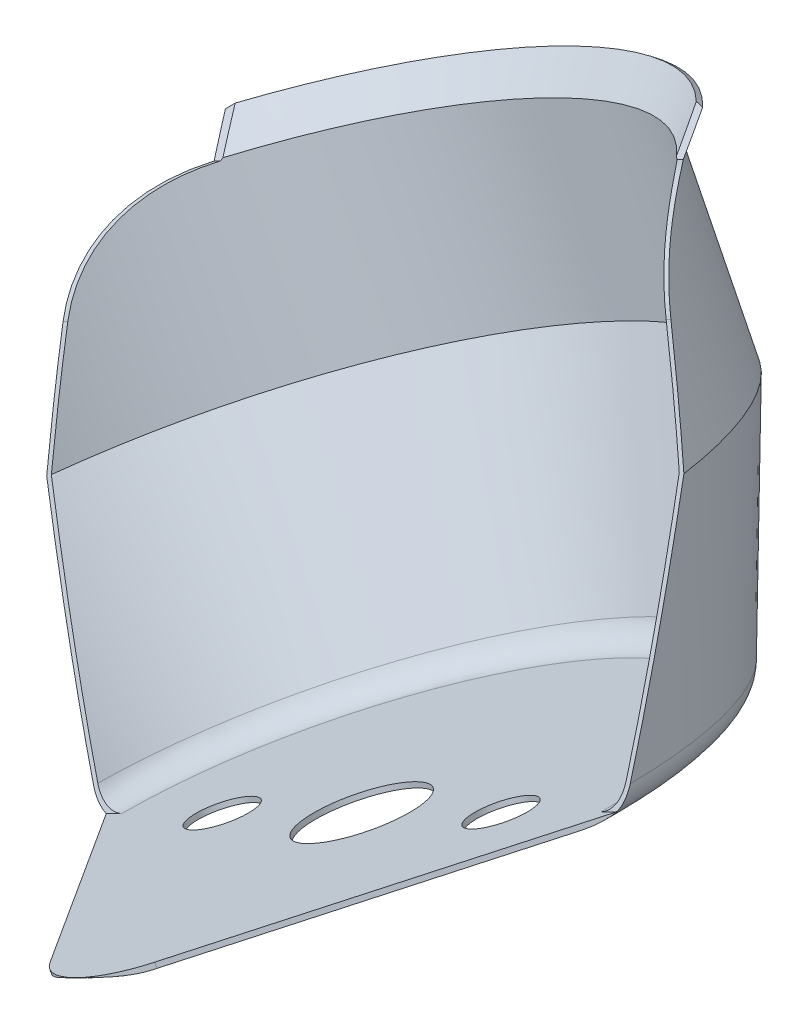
ISO-10303-21;
HEADER;
FILE_DESCRIPTION(('STEP AP214'),'2;1');
FILE_NAME('part.step','',(''),(''),'','','');
FILE_SCHEMA(('AUTOMOTIVE_DESIGN { 1 0 10303 214 1 1 1 1 }'));
ENDSEC;
DATA;
#1=APPLICATION_CONTEXT('core data for automotive mechanical design processes');
#2=APPLICATION_PROTOCOL_DEFINITION('international standard','automotive_design',2000,#1);
#3=PRODUCT_CONTEXT('',#1,'mechanical');
#4=PRODUCT('Part','Part','',(#3));
#5=PRODUCT_RELATED_PRODUCT_CATEGORY('part','',(#4));
#6=PRODUCT_DEFINITION_FORMATION('','',#4);
#7=PRODUCT_DEFINITION_CONTEXT('part definition',#1,'design');
#8=PRODUCT_DEFINITION('design','',#6,#7);
#9=PRODUCT_DEFINITION_SHAPE('','',#8);
#10=(LENGTH_UNIT() NAMED_UNIT(*) SI_UNIT(.MILLI.,.METRE.));
#11=(NAMED_UNIT(*) PLANE_ANGLE_UNIT() SI_UNIT($,.RADIAN.));
#12=(NAMED_UNIT(*) SI_UNIT($,.STERADIAN.) SOLID_ANGLE_UNIT());
#13=UNCERTAINTY_MEASURE_WITH_UNIT(LENGTH_MEASURE(1.E-05),#10,'distance_accuracy_value','');
#14=(GEOMETRIC_REPRESENTATION_CONTEXT(3) GLOBAL_UNCERTAINTY_ASSIGNED_CONTEXT((#13)) GLOBAL_UNIT_ASSIGNED_CONTEXT((#10,
#11,#12)) REPRESENTATION_CONTEXT('',''));
#15=CARTESIAN_POINT('',(0.,0.,0.));
#16=DIRECTION('',(0.,0.,1.));
#17=DIRECTION('',(1.,0.,0.));
#18=AXIS2_PLACEMENT_3D('',#15,#16,#17);
#19=CARTESIAN_POINT('',(-9.43687844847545,95.7288378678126,0.));
#20=DIRECTION('',(0.449375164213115,-0.893343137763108,0.));
#21=DIRECTION('',(0.893343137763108,0.449375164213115,0.));
#22=AXIS2_PLACEMENT_3D('',#19,#20,#21);
#23=TOROIDAL_SURFACE('',#22,27.4999999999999,3.49999999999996);
#24=CARTESIAN_POINT('',(-35.3829669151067,80.1677939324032,-0.991441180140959));
#25=CARTESIAN_POINT('',(-35.2882469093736,80.1246735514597,-0.916985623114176));
#26=CARTESIAN_POINT('',(-35.1934510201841,80.0868394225,-0.839741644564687));
#27=CARTESIAN_POINT('',(-35.0044495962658,80.0210557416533,-0.680786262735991));
#28=CARTESIAN_POINT('',(-34.9102433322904,79.9930895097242,-0.599082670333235));
#29=CARTESIAN_POINT('',(-34.7236481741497,79.9464150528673,-0.432780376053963));
#30=CARTESIAN_POINT('',(-34.63125060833,79.9276288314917,-0.348212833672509));
#31=CARTESIAN_POINT('',(-34.4477621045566,79.8982574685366,-0.176203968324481));
#32=CARTESIAN_POINT('',(-34.3566719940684,79.8876773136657,-0.0887609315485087));
#33=CARTESIAN_POINT('',(-34.1249175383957,79.8702392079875,0.138576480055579));
#34=CARTESIAN_POINT('',(-33.9854240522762,79.8688916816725,0.280103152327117));
#35=CARTESIAN_POINT('',(-33.7111107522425,79.8826071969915,0.566807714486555));
#36=CARTESIAN_POINT('',(-33.5762925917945,79.8976759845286,0.711986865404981));
#37=CARTESIAN_POINT('',(-33.3109634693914,79.942510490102,1.0054911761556));
#38=CARTESIAN_POINT('',(-33.180481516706,79.9723596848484,1.15382957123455));
#39=CARTESIAN_POINT('',(-32.9248632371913,80.0452221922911,1.45180755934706));
#40=CARTESIAN_POINT('',(-32.7997268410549,80.0882353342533,1.60144713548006));
#41=CARTESIAN_POINT('',(-32.4982949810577,80.2087460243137,1.97056981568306));
#42=CARTESIAN_POINT('',(-32.3250768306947,80.2929942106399,2.19037757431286));
#43=CARTESIAN_POINT('',(-31.9903879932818,80.4836629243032,2.62938729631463));
#44=CARTESIAN_POINT('',(-31.8289236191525,80.5900952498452,2.84858887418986));
#45=CARTESIAN_POINT('',(-31.5179054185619,80.8228769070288,3.28506331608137));
#46=CARTESIAN_POINT('',(-31.3683591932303,80.9492387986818,3.5023348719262));
#47=CARTESIAN_POINT('',(-31.0817435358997,81.2202394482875,3.93353081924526));
#48=CARTESIAN_POINT('',(-30.9446691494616,81.364870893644,4.14745651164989));
#49=CARTESIAN_POINT('',(-30.7161623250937,81.6336488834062,4.51826888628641));
#50=CARTESIAN_POINT('',(-30.6218389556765,81.7539856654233,4.6761491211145));
#51=CARTESIAN_POINT('',(-30.441402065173,82.004607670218,4.98864146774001));
#52=CARTESIAN_POINT('',(-30.3552870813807,82.1348911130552,5.14325415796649));
#53=CARTESIAN_POINT('',(-30.1926535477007,82.4052924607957,5.44773929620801));
#54=CARTESIAN_POINT('',(-30.1160991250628,82.5453703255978,5.59762778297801));
#55=CARTESIAN_POINT('',(-30.0096380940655,82.7637614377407,5.81816992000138));
#56=CARTESIAN_POINT('',(-29.9755549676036,82.8379145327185,5.89094811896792));
#57=CARTESIAN_POINT('',(-29.9105309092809,82.9891743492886,6.03481572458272));
#58=CARTESIAN_POINT('',(-29.8795897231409,83.0662808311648,6.10590526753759));
#59=CARTESIAN_POINT('',(-29.8105386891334,83.2527253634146,6.27192298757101));
#60=CARTESIAN_POINT('',(-29.7739995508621,83.3634532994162,6.36596258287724));
#61=CARTESIAN_POINT('',(-29.7093356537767,83.5917287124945,6.54896046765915));
#62=CARTESIAN_POINT('',(-29.6812221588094,83.7092850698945,6.63791182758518));
#63=CARTESIAN_POINT('',(-29.6359927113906,83.9529023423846,6.80896379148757));
#64=CARTESIAN_POINT('',(-29.6189686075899,84.0790249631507,6.89100239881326));
#65=CARTESIAN_POINT('',(-29.6007530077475,84.3394622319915,7.04313908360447));
#66=CARTESIAN_POINT('',(-29.5995197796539,84.4737543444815,7.11326815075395));
#67=CARTESIAN_POINT('',(-29.6154768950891,84.693607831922,7.20975133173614));
#68=CARTESIAN_POINT('',(-29.6254170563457,84.7769091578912,7.24233815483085));
#69=CARTESIAN_POINT('',(-29.6549383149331,84.94490013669,7.29839458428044));
#70=CARTESIAN_POINT('',(-29.6745083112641,85.0295880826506,7.32187463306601));
#71=CARTESIAN_POINT('',(-29.7248338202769,85.1992256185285,7.35756494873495));
#72=CARTESIAN_POINT('',(-29.7557117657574,85.2841675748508,7.36964647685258));
#73=CARTESIAN_POINT('',(-29.8286103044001,85.4500170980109,7.38038023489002));
#74=CARTESIAN_POINT('',(-29.8706223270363,85.530927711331,7.37904276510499));
#75=CARTESIAN_POINT('',(-29.9583963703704,85.6763631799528,7.36414114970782));
#76=CARTESIAN_POINT('',(-30.0031072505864,85.7416900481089,7.35205998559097));
#77=CARTESIAN_POINT('',(-30.0979814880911,85.8657699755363,7.31896731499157));
#78=CARTESIAN_POINT('',(-30.1481493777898,85.9245174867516,7.2979483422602));
#79=CARTESIAN_POINT('',(-30.2800279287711,86.0648372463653,7.23545727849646));
#80=CARTESIAN_POINT('',(-30.3642578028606,86.1418113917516,7.18905863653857));
#81=CARTESIAN_POINT('',(-30.5370638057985,86.281679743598,7.08460931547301));
#82=CARTESIAN_POINT('',(-30.6256522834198,86.3445307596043,7.0265238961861));
#83=CARTESIAN_POINT('',(-30.7986176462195,86.4547403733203,6.9067016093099));
#84=CARTESIAN_POINT('',(-30.8828760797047,86.5028575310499,6.84547453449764));
#85=CARTESIAN_POINT('',(-31.0520553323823,86.5907727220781,6.71807859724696));
#86=CARTESIAN_POINT('',(-31.1369766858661,86.6305631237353,6.6519052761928));
#87=CARTESIAN_POINT('',(-31.3070623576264,86.703238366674,6.5157694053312));
#88=CARTESIAN_POINT('',(-31.3922267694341,86.7361063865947,6.44579813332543));
#89=CARTESIAN_POINT('',(-31.5623168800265,86.7958581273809,6.3030299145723));
#90=CARTESIAN_POINT('',(-31.6472424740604,86.8227395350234,6.23023188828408));
#91=CARTESIAN_POINT('',(-31.8220139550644,86.872810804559,6.07772624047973));
#92=CARTESIAN_POINT('',(-31.9118302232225,86.8956583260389,5.99787324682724));
#93=CARTESIAN_POINT('',(-32.0908212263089,86.9361130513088,5.83613382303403));
#94=CARTESIAN_POINT('',(-32.1799958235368,86.95371916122,5.75424697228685));
#95=CARTESIAN_POINT('',(-32.4465483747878,86.9994708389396,5.50595249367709));
#96=CARTESIAN_POINT('',(-32.6228265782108,87.0205145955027,5.33702392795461));
#97=CARTESIAN_POINT('',(-32.9715037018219,87.046157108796,4.99468801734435));
#98=CARTESIAN_POINT('',(-33.1439084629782,87.0507825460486,4.82128840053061));
#99=CARTESIAN_POINT('',(-33.4846908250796,87.0448833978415,4.47082528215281));
#100=CARTESIAN_POINT('',(-33.6530686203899,87.0343595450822,4.29376195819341));
#101=CARTESIAN_POINT('',(-33.8946390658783,87.0083848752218,4.03415259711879));
#102=CARTESIAN_POINT('',(-33.969681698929,86.9987476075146,3.952701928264));
#103=CARTESIAN_POINT('',(-34.1187907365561,86.9764352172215,3.78923791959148));
#104=CARTESIAN_POINT('',(-34.1928565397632,86.9637583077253,3.70722427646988));
#105=CARTESIAN_POINT('',(-34.4632351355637,86.9115552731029,3.40479292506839));
#106=CARTESIAN_POINT('',(-34.656243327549,86.8626565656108,3.18293762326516));
#107=CARTESIAN_POINT('',(-35.0329907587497,86.742319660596,2.73711760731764));
#108=CARTESIAN_POINT('',(-35.2167217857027,86.670861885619,2.51315122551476));
#109=CARTESIAN_POINT('',(-35.5721978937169,86.5041714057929,2.06524550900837));
#110=CARTESIAN_POINT('',(-35.7439654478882,86.4089849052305,1.84130695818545));
#111=CARTESIAN_POINT('',(-36.0727499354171,86.1928887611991,1.3952764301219));
#112=CARTESIAN_POINT('',(-36.2297882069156,86.0720171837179,1.17318222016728));
#113=CARTESIAN_POINT('',(-36.4158431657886,85.9020100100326,0.896305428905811));
#114=CARTESIAN_POINT('',(-36.4536519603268,85.8659274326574,0.839253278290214));
#115=CARTESIAN_POINT('',(-36.5278834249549,85.7918263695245,0.725569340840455));
#116=CARTESIAN_POINT('',(-36.5643069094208,85.7538090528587,0.668937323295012));
#117=CARTESIAN_POINT('',(-36.6000073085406,85.7147850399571,0.612526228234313));
#118=B_SPLINE_CURVE_WITH_KNOTS('',3,(#24,#25,#26,#27,#28,#29,#30,#31,#32,#33,#34,#35,#36,#37,
#38,#39,#40,#41,#42,#43,#44,#45,#46,#47,#48,#49,#50,#51,#52,#53,#54,#55,#56,#57,#58,#59,#60,#61,
#62,#63,#64,#65,#66,#67,#68,#69,#70,#71,#72,#73,#74,#75,#76,#77,#78,#79,#80,#81,#82,#83,#84,#85,
#86,#87,#88,#89,#90,#91,#92,#93,#94,#95,#96,#97,#98,#99,#100,#101,#102,#103,#104,#105,#106,#107,
#108,#109,#110,#111,#112,#113,#114,#115,#116,#117),.UNSPECIFIED.,.F.,.F.,(4,2,2,2,2,2,2,2,2,2,2,
2,2,2,2,2,2,2,2,2,2,2,2,2,2,2,2,2,2,2,2,2,2,2,2,2,2,2,2,2,2,2,2,2,2,2,4),(0.,0.383604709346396,
0.76655785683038,1.14619814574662,1.52606895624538,2.12129102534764,2.71672149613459,
3.31555386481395,3.91437846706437,4.78988966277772,5.66586767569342,6.54239996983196,
7.41858252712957,8.07756406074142,8.73642794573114,9.39274023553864,9.72070377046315,
10.0486407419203,10.4976484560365,10.9472537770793,11.4005371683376,11.8526223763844,
12.1218487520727,12.3907654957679,12.6626843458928,12.9343944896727,13.1735747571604,
13.4129552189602,13.7803703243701,14.1488941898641,14.4925854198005,14.8365902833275,
15.1814216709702,15.5263860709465,15.8932331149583,16.2601566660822,16.9945261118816,
17.7277016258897,18.4608416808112,18.7943083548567,19.1279715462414,20.0212286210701,
20.9152630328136,21.8075700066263,22.6985636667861,22.9306515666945,23.1626008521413),.UNSPECIFIED.);
#119=CARTESIAN_POINT('',(-34.2661864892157,79.8808688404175,0.));
#120=VERTEX_POINT('',#119);
#121=CARTESIAN_POINT('',(-32.3555366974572,80.2822807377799,2.15382842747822));
#122=VERTEX_POINT('',#121);
#123=EDGE_CURVE('E735',#120,#122,#118,.T.);
#124=ORIENTED_EDGE('',*,*,#123,.F.);
#125=CARTESIAN_POINT('',(-36.4276256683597,80.8619119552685,-0.861599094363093));
#126=CARTESIAN_POINT('',(-36.3567121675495,80.7916359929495,-0.817464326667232));
#127=CARTESIAN_POINT('',(-36.2825019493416,80.7243250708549,-0.773873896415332));
#128=CARTESIAN_POINT('',(-36.1279208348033,80.5961572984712,-0.688090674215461));
#129=CARTESIAN_POINT('',(-36.0475484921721,80.5353019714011,-0.645898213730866));
#130=CARTESIAN_POINT('',(-35.8835125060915,80.4222588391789,-0.564434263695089));
#131=CARTESIAN_POINT('',(-35.8000108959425,80.3698715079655,-0.525113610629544));
#132=CARTESIAN_POINT('',(-35.6281200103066,80.2721906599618,-0.448403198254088));
#133=CARTESIAN_POINT('',(-35.5397311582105,80.2268965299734,-0.411013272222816));
#134=CARTESIAN_POINT('',(-35.3589997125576,80.1440476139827,-0.338628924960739));
#135=CARTESIAN_POINT('',(-35.2666767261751,80.1064588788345,-0.303624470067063));
#136=CARTESIAN_POINT('',(-35.0783046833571,80.0391997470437,-0.236133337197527));
#137=CARTESIAN_POINT('',(-34.9822558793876,80.0095288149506,-0.20364648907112));
#138=CARTESIAN_POINT('',(-34.7842028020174,79.9577543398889,-0.140577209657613));
#139=CARTESIAN_POINT('',(-34.6821064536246,79.9358990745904,-0.110078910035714));
#140=CARTESIAN_POINT('',(-34.4754002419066,79.9013660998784,-0.0523787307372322));
#141=CARTESIAN_POINT('',(-34.3707890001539,79.8886935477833,-0.0251787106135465));
#142=CARTESIAN_POINT('',(-34.2653559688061,79.8808065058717,0.000200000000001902));
#143=B_SPLINE_CURVE_WITH_KNOTS('',3,(#125,#126,#127,#128,#129,#130,#131,#132,#133,#134,#135,
#136,#137,#138,#139,#140,#141,#142),.UNSPECIFIED.,.F.,.F.,(4,2,2,2,2,2,2,2,4),(0.,
0.327401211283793,0.654879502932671,0.972902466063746,1.29089792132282,1.60746069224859,
1.9240020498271,2.24985482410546,2.57589046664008),.UNSPECIFIED.);
#144=CARTESIAN_POINT('',(-36.4168245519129,80.851257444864,-0.854897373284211));
#145=VERTEX_POINT('',#144);
#146=EDGE_CURVE('E696',#145,#120,#143,.T.);
#147=ORIENTED_EDGE('',*,*,#146,.F.);
#148=CARTESIAN_POINT('',(-8.91260742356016,94.686604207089,0.));
#149=DIRECTION('',(0.449375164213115,-0.893343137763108,0.));
#150=DIRECTION('',(0.893343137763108,0.449375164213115,0.));
#151=AXIS2_PLACEMENT_3D('',#148,#149,#150);
#152=CIRCLE('',#151,30.7998316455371);
#153=CARTESIAN_POINT('',(18.5916097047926,108.521950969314,-0.854897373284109));
#154=VERTEX_POINT('',#153);
#155=EDGE_CURVE('E643',#145,#154,#152,.T.);
#156=ORIENTED_EDGE('',*,*,#155,.T.);
#157=CARTESIAN_POINT('',(11.8348809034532,109.510621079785,-2.68260319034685));
#158=CARTESIAN_POINT('',(11.7941476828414,109.420069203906,-2.65341727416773));
#159=CARTESIAN_POINT('',(11.7577412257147,109.328090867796,-2.62273047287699));
#160=CARTESIAN_POINT('',(11.6935849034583,109.142134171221,-2.5587097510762));
#161=CARTESIAN_POINT('',(11.6658290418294,109.048157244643,-2.52537768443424));
#162=CARTESIAN_POINT('',(11.6190344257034,108.859388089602,-2.45654727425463));
#163=CARTESIAN_POINT('',(11.5999539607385,108.764602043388,-2.42106024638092));
#164=CARTESIAN_POINT('',(11.5701755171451,108.57449099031,-2.34810514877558));
#165=CARTESIAN_POINT('',(11.5594788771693,108.479165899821,-2.31063676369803));
#166=CARTESIAN_POINT('',(11.5397516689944,108.193900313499,-2.19593667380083));
#167=CARTESIAN_POINT('',(11.5429249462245,108.004010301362,-2.11616871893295));
#168=CARTESIAN_POINT('',(11.5800055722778,107.629127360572,-1.95223256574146));
#169=CARTESIAN_POINT('',(11.6139539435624,107.444141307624,-1.86805863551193));
#170=CARTESIAN_POINT('',(11.7150507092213,107.065636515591,-1.68919932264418));
#171=CARTESIAN_POINT('',(11.7850609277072,106.872990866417,-1.59427795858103));
#172=CARTESIAN_POINT('',(11.9565779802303,106.502518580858,-1.40400840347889));
#173=CARTESIAN_POINT('',(12.0580936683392,106.324696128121,-1.30866009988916));
#174=CARTESIAN_POINT('',(12.2999347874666,105.973355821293,-1.11162420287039));
#175=CARTESIAN_POINT('',(12.442847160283,105.80152352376,-1.01009668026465));
#176=CARTESIAN_POINT('',(12.7594700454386,105.485174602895,-0.811966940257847));
#177=CARTESIAN_POINT('',(12.9331887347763,105.340665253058,-0.715366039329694));
#178=CARTESIAN_POINT('',(13.2132564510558,105.149065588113,-0.576863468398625));
#179=CARTESIAN_POINT('',(13.3097110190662,105.089459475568,-0.531821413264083));
#180=CARTESIAN_POINT('',(13.5086410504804,104.979192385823,-0.444201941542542));
#181=CARTESIAN_POINT('',(13.6111134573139,104.928526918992,-0.401623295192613));
#182=CARTESIAN_POINT('',(13.8214161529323,104.836866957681,-0.31937193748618));
#183=CARTESIAN_POINT('',(13.9292465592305,104.795872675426,-0.279699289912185));
#184=CARTESIAN_POINT('',(14.149403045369,104.724298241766,-0.203750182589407));
#185=CARTESIAN_POINT('',(14.2617262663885,104.693711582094,-0.167471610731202));
#186=CARTESIAN_POINT('',(14.4790332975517,104.646001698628,-0.10206091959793));
#187=CARTESIAN_POINT('',(14.5836902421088,104.627869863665,-0.0725771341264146));
#188=CARTESIAN_POINT('',(14.7950784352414,104.601100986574,-0.0171301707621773));
#189=CARTESIAN_POINT('',(14.9018084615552,104.592458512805,0.00883501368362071));
#190=CARTESIAN_POINT('',(15.116420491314,104.58501163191,0.0569085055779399));
#191=CARTESIAN_POINT('',(15.2243018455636,104.58620194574,0.0790188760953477));
#192=CARTESIAN_POINT('',(15.4402546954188,104.59865191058,0.119084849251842));
#193=CARTESIAN_POINT('',(15.5483261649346,104.609910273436,0.137040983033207));
#194=CARTESIAN_POINT('',(15.7505801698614,104.640618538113,0.166630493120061));
#195=CARTESIAN_POINT('',(15.8448657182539,104.65891664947,0.178765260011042));
#196=CARTESIAN_POINT('',(16.0320105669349,104.703342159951,0.199474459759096));
#197=CARTESIAN_POINT('',(16.1248693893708,104.729472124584,0.208047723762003));
#198=CARTESIAN_POINT('',(16.3082942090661,104.789406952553,0.22151664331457));
#199=CARTESIAN_POINT('',(16.3988615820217,104.82320708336,0.226414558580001));
#200=CARTESIAN_POINT('',(16.5770030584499,104.898240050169,0.232486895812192));
#201=CARTESIAN_POINT('',(16.6645761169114,104.939475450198,0.233660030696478));
#202=CARTESIAN_POINT('',(16.9097828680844,105.067644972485,0.231650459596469));
#203=CARTESIAN_POINT('',(17.0629070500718,105.163384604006,0.223854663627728));
#204=CARTESIAN_POINT('',(17.3517313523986,105.376432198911,0.195627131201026));
#205=CARTESIAN_POINT('',(17.4874456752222,105.493722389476,0.175205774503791));
#206=CARTESIAN_POINT('',(17.7033674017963,105.710974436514,0.129950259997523));
#207=CARTESIAN_POINT('',(17.7885129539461,105.806678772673,0.107924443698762));
#208=CARTESIAN_POINT('',(17.9472213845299,106.005873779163,0.0582021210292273));
#209=CARTESIAN_POINT('',(18.0207840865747,106.109364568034,0.0305055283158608));
#210=CARTESIAN_POINT('',(18.194824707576,106.384622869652,-0.0476898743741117));
#211=CARTESIAN_POINT('',(18.2861531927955,106.5611643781,-0.102094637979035));
#212=CARTESIAN_POINT('',(18.4366714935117,106.924143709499,-0.221761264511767));
#213=CARTESIAN_POINT('',(18.4958105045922,107.110596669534,-0.287040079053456));
#214=CARTESIAN_POINT('',(18.584993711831,107.503132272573,-0.431871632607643));
#215=CARTESIAN_POINT('',(18.6122682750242,107.70957471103,-0.512154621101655));
#216=CARTESIAN_POINT('',(18.6293168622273,108.121050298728,-0.679991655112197));
#217=CARTESIAN_POINT('',(18.6190781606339,108.326082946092,-0.767548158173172));
#218=CARTESIAN_POINT('',(18.5669349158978,108.697961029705,-0.933388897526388));
#219=CARTESIAN_POINT('',(18.5301337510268,108.865836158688,-1.01103267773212));
#220=CARTESIAN_POINT('',(18.4321182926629,109.193024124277,-1.16786912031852));
#221=CARTESIAN_POINT('',(18.3709624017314,109.352356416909,-1.24705764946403));
#222=CARTESIAN_POINT('',(18.298227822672,109.506149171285,-1.3263648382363));
#223=B_SPLINE_CURVE_WITH_KNOTS('',3,(#157,#158,#159,#160,#161,#162,#163,#164,#165,#166,#167,
#168,#169,#170,#171,#172,#173,#174,#175,#176,#177,#178,#179,#180,#181,#182,#183,#184,#185,#186,
#187,#188,#189,#190,#191,#192,#193,#194,#195,#196,#197,#198,#199,#200,#201,#202,#203,#204,#205,
#206,#207,#208,#209,#210,#211,#212,#213,#214,#215,#216,#217,#218,#219,#220,#221,#222),
.UNSPECIFIED.,.F.,.F.,(4,2,2,2,2,2,2,2,2,2,2,2,2,2,2,2,2,2,2,2,2,2,2,2,2,2,2,2,2,2,2,2,4),(0.,
0.310319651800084,0.62042371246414,0.92902063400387,1.23766681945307,1.85282594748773,
2.46880627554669,3.14363208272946,3.81864771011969,4.55171828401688,5.28498373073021,
5.65058721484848,6.01600658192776,6.38143396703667,6.74663241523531,7.07686754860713,
7.40691355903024,7.73678238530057,8.06660901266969,8.35665415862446,8.64679441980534,
8.93675614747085,9.22681805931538,9.76630664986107,10.3053523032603,10.6944291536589,
11.0835119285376,11.6983543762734,12.3141644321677,12.9802518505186,13.6465652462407,
14.2105722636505,14.773234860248),.UNSPECIFIED.);
#224=CARTESIAN_POINT('',(18.0886805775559,106.216748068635,0.));
#225=VERTEX_POINT('',#224);
#226=EDGE_CURVE('E702',#225,#154,#223,.T.);
#227=ORIENTED_EDGE('',*,*,#226,.F.);
#228=CARTESIAN_POINT('',(10.8676511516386,106.216948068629,7.36195137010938));
#229=CARTESIAN_POINT('',(10.8813855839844,106.179281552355,7.36726599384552));
#230=CARTESIAN_POINT('',(10.8962585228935,106.141845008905,7.37130193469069));
#231=CARTESIAN_POINT('',(10.9281888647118,106.067731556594,7.3767571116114));
#232=CARTESIAN_POINT('',(10.9452457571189,106.031054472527,7.3781769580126));
#233=CARTESIAN_POINT('',(10.9813046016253,105.959048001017,7.37834243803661));
#234=CARTESIAN_POINT('',(11.0002888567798,105.923709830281,7.37711061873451));
#235=CARTESIAN_POINT('',(11.0401442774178,105.854318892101,7.37206399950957));
#236=CARTESIAN_POINT('',(11.0610153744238,105.820266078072,7.3682492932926));
#237=CARTESIAN_POINT('',(11.1261385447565,105.720390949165,7.35307528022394));
#238=CARTESIAN_POINT('',(11.1729498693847,105.656754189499,7.33798587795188));
#239=CARTESIAN_POINT('',(11.2715205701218,105.536250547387,7.29929045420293));
#240=CARTESIAN_POINT('',(11.3232891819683,105.479396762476,7.27566829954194));
#241=CARTESIAN_POINT('',(11.4638249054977,105.338658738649,7.20456549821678));
#242=CARTESIAN_POINT('',(11.5553136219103,105.260374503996,7.15143813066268));
#243=CARTESIAN_POINT('',(11.7423213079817,105.119045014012,7.033259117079));
#244=CARTESIAN_POINT('',(11.8378535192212,105.056055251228,6.96816551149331));
#245=CARTESIAN_POINT('',(12.0266890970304,104.944635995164,6.83278343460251));
#246=CARTESIAN_POINT('',(12.1199360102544,104.895738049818,6.76279276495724));
#247=CARTESIAN_POINT('',(12.3068562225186,104.807200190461,6.61762872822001));
#248=CARTESIAN_POINT('',(12.4005298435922,104.767569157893,6.54245047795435));
#249=CARTESIAN_POINT('',(12.587814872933,104.695983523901,6.38822054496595));
#250=CARTESIAN_POINT('',(12.6814260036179,104.66403991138,6.30916350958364));
#251=CARTESIAN_POINT('',(12.8681903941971,104.606751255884,6.14813217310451));
#252=CARTESIAN_POINT('',(12.9613434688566,104.581408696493,6.06615678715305));
#253=CARTESIAN_POINT('',(13.1510024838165,104.535539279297,5.8963179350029));
#254=CARTESIAN_POINT('',(13.2474790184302,104.515268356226,5.80835319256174));
#255=CARTESIAN_POINT('',(13.4395884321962,104.480358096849,5.63039567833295));
#256=CARTESIAN_POINT('',(13.5352211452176,104.465719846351,5.54040251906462));
#257=CARTESIAN_POINT('',(13.8208367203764,104.429489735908,5.26778958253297));
#258=CARTESIAN_POINT('',(14.009420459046,104.415609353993,5.08264141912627));
#259=CARTESIAN_POINT('',(14.382587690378,104.406086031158,4.70707038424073));
#260=CARTESIAN_POINT('',(14.5671596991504,104.41048989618,4.51663521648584));
#261=CARTESIAN_POINT('',(14.9311797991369,104.436675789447,4.13207647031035));
#262=CARTESIAN_POINT('',(15.1106275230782,104.458459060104,3.93795262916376));
#263=CARTESIAN_POINT('',(15.4779049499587,104.521698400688,3.5310700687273));
#264=CARTESIAN_POINT('',(15.665229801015,104.564610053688,3.31807956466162));
#265=CARTESIAN_POINT('',(16.0315838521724,104.671086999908,2.88996399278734));
#266=CARTESIAN_POINT('',(16.2106101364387,104.734659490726,2.6748382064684));
#267=CARTESIAN_POINT('',(16.5574223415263,104.88313861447,2.24510529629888));
#268=CARTESIAN_POINT('',(16.7252695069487,104.967914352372,2.03050286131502));
#269=CARTESIAN_POINT('',(17.0483560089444,105.160510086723,1.6023337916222));
#270=CARTESIAN_POINT('',(17.2036048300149,105.268312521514,1.38876649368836));
#271=CARTESIAN_POINT('',(17.4904333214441,105.502557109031,0.976203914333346));
#272=CARTESIAN_POINT('',(17.6228389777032,105.627675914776,0.777045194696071));
#273=CARTESIAN_POINT('',(17.8082677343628,105.833923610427,0.482220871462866));
#274=CARTESIAN_POINT('',(17.8680069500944,105.905961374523,0.384370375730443));
#275=CARTESIAN_POINT('',(17.9823915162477,106.056518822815,0.190538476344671));
#276=CARTESIAN_POINT('',(18.0370322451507,106.135044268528,0.0945588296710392));
#277=CARTESIAN_POINT('',(18.0887898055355,106.216920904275,-0.000199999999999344));
#278=B_SPLINE_CURVE_WITH_KNOTS('',3,(#228,#229,#230,#231,#232,#233,#234,#235,#236,#237,#238,
#239,#240,#241,#242,#243,#244,#245,#246,#247,#248,#249,#250,#251,#252,#253,#254,#255,#256,#257,
#258,#259,#260,#261,#262,#263,#264,#265,#266,#267,#268,#269,#270,#271,#272,#273,#274,#275,#276,
#277),.UNSPECIFIED.,.F.,.F.,(4,2,2,2,2,2,2,2,2,2,2,2,2,2,2,2,2,2,2,2,2,2,2,2,4),(0.,
0.121299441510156,0.242570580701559,0.362814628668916,0.483054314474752,0.723209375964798,
0.963820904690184,1.35636188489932,1.75030651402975,2.12903358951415,2.50812216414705,
2.88774945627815,3.26751937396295,3.66372793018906,4.06001282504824,4.85305866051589,
5.64813586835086,6.44326991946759,7.30305651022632,8.16314294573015,9.01804544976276,
9.8722982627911,10.6803523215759,11.0863149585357,11.492642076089),.UNSPECIFIED.);
#279=CARTESIAN_POINT('',(16.6274059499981,104.921993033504,2.15382842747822));
#280=VERTEX_POINT('',#279);
#281=EDGE_CURVE('E513',#280,#225,#278,.T.);
#282=ORIENTED_EDGE('',*,*,#281,.F.);
#283=CARTESIAN_POINT('',(-7.86406537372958,92.6021368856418,0.));
#284=DIRECTION('',(0.449375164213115,-0.893343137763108,0.));
#285=DIRECTION('',(0.893343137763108,0.449375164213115,0.));
#286=AXIS2_PLACEMENT_3D('',#283,#284,#285);
#287=CIRCLE('',#286,27.4999999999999);
#288=EDGE_CURVE('E646',#122,#280,#287,.T.);
#289=ORIENTED_EDGE('',*,*,#288,.F.);
#290=EDGE_LOOP('',(#124,#147,#156,#227,#282,#289));
#291=FACE_BOUND('',#290,.T.);
#292=ADVANCED_FACE('F368',(#291),#23,.T.);
#293=CARTESIAN_POINT('',(18.8737568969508,39.4482201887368,0.));
#294=DIRECTION('',(0.449375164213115,-0.893343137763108,0.));
#295=DIRECTION('',(0.893343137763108,0.449375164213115,0.));
#296=AXIS2_PLACEMENT_3D('',#293,#294,#295);
#297=CYLINDRICAL_SURFACE('',#296,5.5);
#298=CARTESIAN_POINT('',(-7.86406537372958,92.6021368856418,0.));
#299=DIRECTION('',(0.449375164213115,-0.893343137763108,0.));
#300=DIRECTION('',(0.893343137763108,0.449375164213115,0.));
#301=AXIS2_PLACEMENT_3D('',#298,#299,#300);
#302=CIRCLE('',#301,5.5);
#303=CARTESIAN_POINT('',(-2.95067811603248,95.0737002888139,0.));
#304=VERTEX_POINT('',#303);
#305=EDGE_CURVE('E650',#304,#304,#302,.T.);
#306=ORIENTED_EDGE('',*,*,#305,.T.);
#307=EDGE_LOOP('',(#306));
#308=FACE_BOUND('',#307,.T.);
#309=CARTESIAN_POINT('',(-8.08875295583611,93.0488084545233,0.));
#310=DIRECTION('',(0.449375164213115,-0.893343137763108,0.));
#311=DIRECTION('',(0.893343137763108,0.449375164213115,0.));
#312=AXIS2_PLACEMENT_3D('',#309,#310,#311);
#313=CIRCLE('',#312,5.50000000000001);
#314=CARTESIAN_POINT('',(-3.175365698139,95.5203718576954,0.));
#315=VERTEX_POINT('',#314);
#316=EDGE_CURVE('E574',#315,#315,#313,.T.);
#317=ORIENTED_EDGE('',*,*,#316,.F.);
#318=EDGE_LOOP('',(#317));
#319=FACE_BOUND('',#318,.T.);
#320=ADVANCED_FACE('F370',(#308,#319),#297,.F.);
#321=CARTESIAN_POINT('',(16.7028709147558,104.959953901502,0.));
#322=DIRECTION('',(0.449375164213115,-0.893343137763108,0.));
#323=DIRECTION('',(0.893343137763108,0.449375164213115,0.));
#324=AXIS2_PLACEMENT_3D('',#321,#322,#323);
#325=PLANE('',#324);
#326=CARTESIAN_POINT('',(6.42942483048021,99.7921395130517,0.));
#327=DIRECTION('',(0.449375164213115,-0.893343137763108,0.));
#328=DIRECTION('',(0.893343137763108,0.449375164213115,0.));
#329=AXIS2_PLACEMENT_3D('',#326,#327,#328);
#330=CIRCLE('',#329,3.00000000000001);
#331=CARTESIAN_POINT('',(9.10945424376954,101.140265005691,0.));
#332=VERTEX_POINT('',#331);
#333=EDGE_CURVE('E906',#332,#332,#330,.T.);
#334=ORIENTED_EDGE('',*,*,#333,.F.);
#335=EDGE_LOOP('',(#334));
#336=FACE_BOUND('',#335,.T.);
#337=CARTESIAN_POINT('',(-22.1575555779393,85.4121342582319,0.));
#338=DIRECTION('',(0.449375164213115,-0.893343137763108,0.));
#339=DIRECTION('',(0.893343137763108,0.449375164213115,0.));
#340=AXIS2_PLACEMENT_3D('',#337,#338,#339);
#341=CIRCLE('',#340,3.);
#342=CARTESIAN_POINT('',(-19.47752616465,86.7602597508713,0.));
#343=VERTEX_POINT('',#342);
#344=EDGE_CURVE('E518',#343,#343,#341,.T.);
#345=ORIENTED_EDGE('',*,*,#344,.F.);
#346=EDGE_LOOP('',(#345));
#347=FACE_BOUND('',#346,.T.);
#348=DIRECTION('',(0.588738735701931,0.296151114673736,0.752117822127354));
#349=VECTOR('',#348,1.);
#350=CARTESIAN_POINT('',(-12.0022660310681,90.5205127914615,28.1552730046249));
#351=LINE('',#350,#349);
#352=CARTESIAN_POINT('',(-13.239259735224,89.8982723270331,26.5750049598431));
#353=VERTEX_POINT('',#352);
#354=EDGE_CURVE('E730',#122,#353,#351,.T.);
#355=ORIENTED_EDGE('',*,*,#354,.F.);
#356=ORIENTED_EDGE('',*,*,#288,.T.);
#357=DIRECTION('',(0.588738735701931,0.296151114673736,-0.752117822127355));
#358=VECTOR('',#357,1.);
#359=CARTESIAN_POINT('',(17.6138989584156,105.4182250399,0.893576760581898));
#360=LINE('',#359,#358);
#361=CARTESIAN_POINT('',(-2.48887101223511,95.3060014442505,26.5750049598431));
#362=VERTEX_POINT('',#361);
#363=EDGE_CURVE('E536',#362,#280,#360,.T.);
#364=ORIENTED_EDGE('',*,*,#363,.F.);
#365=CARTESIAN_POINT('',(-7.86406537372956,92.6021368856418,21.3027756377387));
#366=DIRECTION('',(0.449375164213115,-0.893343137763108,0.));
#367=DIRECTION('',(0.893343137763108,0.449375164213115,0.));
#368=AXIS2_PLACEMENT_3D('',#365,#366,#367);
#369=CIRCLE('',#368,8.);
#370=CARTESIAN_POINT('',(-2.75720113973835,95.1710243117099,26.899270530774));
#371=VERTEX_POINT('',#370);
#372=EDGE_CURVE('E503',#371,#362,#369,.F.);
#373=ORIENTED_EDGE('',*,*,#372,.F.);
#374=CARTESIAN_POINT('',(-12.9709296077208,90.0332494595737,26.899270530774));
#375=VERTEX_POINT('',#374);
#376=EDGE_CURVE('E649',#371,#375,#287,.T.);
#377=ORIENTED_EDGE('',*,*,#376,.T.);
#378=EDGE_CURVE('E739',#353,#375,#369,.F.);
#379=ORIENTED_EDGE('',*,*,#378,.F.);
#380=EDGE_LOOP('',(#355,#356,#364,#373,#377,#379));
#381=FACE_BOUND('',#380,.T.);
#382=ORIENTED_EDGE('',*,*,#305,.F.);
#383=EDGE_LOOP('',(#382));
#384=FACE_BOUND('',#383,.T.);
#385=ADVANCED_FACE('F768',(#336,#347,#381,#384),#325,.T.);
#386=CARTESIAN_POINT('',(-13.2435147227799,89.9063411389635,26.5748049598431));
#387=CARTESIAN_POINT('',(-13.1843192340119,89.9314843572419,26.6480582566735));
#388=CARTESIAN_POINT('',(-13.1245700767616,89.958571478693,26.7201696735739));
#389=CARTESIAN_POINT('',(-13.0039424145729,90.0162901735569,26.8619617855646));
#390=CARTESIAN_POINT('',(-12.9430641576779,90.0469209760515,26.931643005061));
#391=CARTESIAN_POINT('',(-12.75882855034,90.1435454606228,27.1366847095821));
#392=CARTESIAN_POINT('',(-12.6337119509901,90.2143404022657,27.2682401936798));
#393=CARTESIAN_POINT('',(-12.3791645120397,90.3659365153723,27.5198343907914));
#394=CARTESIAN_POINT('',(-12.2497499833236,90.4467024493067,27.6399111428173));
#395=CARTESIAN_POINT('',(-11.9860026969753,90.6162366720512,27.8685453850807));
#396=CARTESIAN_POINT('',(-11.851668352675,90.7050075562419,27.9770991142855));
#397=CARTESIAN_POINT('',(-11.5743695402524,90.8909080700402,28.1849111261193));
#398=CARTESIAN_POINT('',(-11.4312707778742,90.988196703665,28.2838475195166));
#399=CARTESIAN_POINT('',(-11.1396571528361,91.1869639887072,28.4686723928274));
#400=CARTESIAN_POINT('',(-10.9911420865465,91.2884427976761,28.5545603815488));
#401=CARTESIAN_POINT('',(-10.68838405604,91.4937825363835,28.7130295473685));
#402=CARTESIAN_POINT('',(-10.5341332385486,91.5976466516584,28.7855916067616));
#403=CARTESIAN_POINT('',(-10.2201524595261,91.805701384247,28.9168683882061));
#404=CARTESIAN_POINT('',(-10.0604245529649,91.909891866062,28.9755882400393));
#405=CARTESIAN_POINT('',(-9.71254821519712,92.1315181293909,29.0861701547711));
#406=CARTESIAN_POINT('',(-9.52357616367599,92.2487422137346,29.1358864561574));
#407=CARTESIAN_POINT('',(-9.13909856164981,92.4789483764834,29.2163690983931));
#408=CARTESIAN_POINT('',(-8.94359269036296,92.5919302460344,29.2471345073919));
#409=CARTESIAN_POINT('',(-8.54725847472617,92.8115620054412,29.2893366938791));
#410=CARTESIAN_POINT('',(-8.34643560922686,92.9182180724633,29.300792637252));
#411=CARTESIAN_POINT('',(-7.94080169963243,93.1239700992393,29.304286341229));
#412=CARTESIAN_POINT('',(-7.735990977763,93.2230666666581,29.2963256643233));
#413=CARTESIAN_POINT('',(-7.33996914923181,93.4059157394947,29.2624371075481));
#414=CARTESIAN_POINT('',(-7.14890879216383,93.4902620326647,29.2379221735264));
#415=CARTESIAN_POINT('',(-6.76671317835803,93.6522047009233,29.1726619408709));
#416=CARTESIAN_POINT('',(-6.57557792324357,93.7298012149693,29.1319169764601));
#417=CARTESIAN_POINT('',(-6.19473913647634,93.8790000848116,29.0344884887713));
#418=CARTESIAN_POINT('',(-6.0050378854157,93.9505942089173,28.9777835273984));
#419=CARTESIAN_POINT('',(-5.62900369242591,94.088735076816,28.8488386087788));
#420=CARTESIAN_POINT('',(-5.44267247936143,94.1552792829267,28.7765909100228));
#421=CARTESIAN_POINT('',(-5.06836994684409,94.2869705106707,28.6140230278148));
#422=CARTESIAN_POINT('',(-4.88059674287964,94.3519728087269,28.5231292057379));
#423=CARTESIAN_POINT('',(-4.51264599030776,94.4794817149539,28.3255837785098));
#424=CARTESIAN_POINT('',(-4.33246829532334,94.5419883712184,28.2189324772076));
#425=CARTESIAN_POINT('',(-3.9822217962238,94.6660891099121,27.9906863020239));
#426=CARTESIAN_POINT('',(-3.81212778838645,94.7276851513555,27.8691312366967));
#427=CARTESIAN_POINT('',(-3.48383180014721,94.8519737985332,27.6115424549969));
#428=CARTESIAN_POINT('',(-3.32562294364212,94.9146657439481,27.4755172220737));
#429=CARTESIAN_POINT('',(-3.05028054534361,95.0318011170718,27.215152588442));
#430=CARTESIAN_POINT('',(-2.93084066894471,95.0857335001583,27.0930245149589));
#431=CARTESIAN_POINT('',(-2.70308136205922,95.1970619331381,26.8401729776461));
#432=CARTESIAN_POINT('',(-2.5947673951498,95.2544596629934,26.7094453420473));
#433=CARTESIAN_POINT('',(-2.4928129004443,95.3142277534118,26.5748049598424));
#434=B_SPLINE_CURVE_WITH_KNOTS('',3,(#386,#387,#388,#389,#390,#391,#392,#393,#394,#395,#396,
#397,#398,#399,#400,#401,#402,#403,#404,#405,#406,#407,#408,#409,#410,#411,#412,#413,#414,#415,
#416,#417,#418,#419,#420,#421,#422,#423,#424,#425,#426,#427,#428,#429,#430,#431,#432,#433),
.UNSPECIFIED.,.F.,.F.,(4,2,2,2,2,2,2,2,2,2,2,2,2,2,2,2,2,2,2,2,2,2,2,4),(0.,0.292376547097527,
0.584689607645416,1.16853239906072,1.7503679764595,2.33239288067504,2.92981544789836,
3.52726049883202,4.12555607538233,4.72362957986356,5.40632235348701,6.0890486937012,
6.77109698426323,7.45309039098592,8.08320046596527,8.71329756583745,9.34424510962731,
9.97550764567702,10.6303188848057,11.2851174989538,11.938203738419,12.5909091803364,
13.1277608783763,13.664874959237),.UNSPECIFIED.);
#435=CARTESIAN_POINT('',(-8.08875295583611,93.0488084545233,29.3027756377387));
#436=VERTEX_POINT('',#435);
#437=EDGE_CURVE('E780',#375,#436,#434,.T.);
#438=ORIENTED_EDGE('',*,*,#437,.F.);
#439=ORIENTED_EDGE('',*,*,#376,.F.);
#440=EDGE_CURVE('E782',#436,#371,#434,.T.);
#441=ORIENTED_EDGE('',*,*,#440,.F.);
#442=EDGE_LOOP('',(#438,#439,#441));
#443=FACE_BOUND('',#442,.T.);
#444=ADVANCED_FACE('F538',(#443),#23,.T.);
#445=CARTESIAN_POINT('',(-8.91260742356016,94.686604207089,0.));
#446=DIRECTION('',(-0.449375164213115,0.893343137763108,0.));
#447=DIRECTION('',(-0.893343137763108,-0.449375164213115,0.));
#448=AXIS2_PLACEMENT_3D('',#445,#446,#447);
#449=CONICAL_SURFACE('',#448,30.7998316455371,0.339836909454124);
#450=CARTESIAN_POINT('',(-59.9092912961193,196.066344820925,-53.7731405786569));
#451=DIRECTION('',(0.18991415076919,-0.377543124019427,-0.90630778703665));
#452=DIRECTION('',(-0.407272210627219,0.80964384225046,-0.4226182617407));
#453=AXIS2_PLACEMENT_3D('',#450,#451,#452);
#454=ELLIPSE('',#453,167.816509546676,46.243108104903);
#455=CARTESIAN_POINT('',(-50.7274708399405,96.4491860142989,-10.3513234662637));
#456=VERTEX_POINT('',#455);
#457=EDGE_CURVE('E701',#456,#145,#454,.F.);
#458=ORIENTED_EDGE('',*,*,#457,.F.);
#459=CARTESIAN_POINT('',(-18.0642007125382,112.879672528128,0.));
#460=DIRECTION('',(0.449375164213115,-0.893343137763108,0.));
#461=DIRECTION('',(0.893343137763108,0.449375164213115,0.));
#462=AXIS2_PLACEMENT_3D('',#459,#460,#461);
#463=CIRCLE('',#462,38.);
#464=CARTESIAN_POINT('',(14.5990694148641,129.310159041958,-10.3513234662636));
#465=VERTEX_POINT('',#464);
#466=EDGE_CURVE('E640',#456,#465,#463,.T.);
#467=ORIENTED_EDGE('',*,*,#466,.T.);
#468=EDGE_CURVE('E706',#154,#465,#454,.F.);
#469=ORIENTED_EDGE('',*,*,#468,.F.);
#470=ORIENTED_EDGE('',*,*,#155,.F.);
#471=EDGE_LOOP('',(#458,#467,#469,#470));
#472=FACE_BOUND('',#471,.T.);
#473=ADVANCED_FACE('F591',(#472),#449,.T.);
#474=CARTESIAN_POINT('',(18.8737568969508,39.4482201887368,0.));
#475=DIRECTION('',(0.449375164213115,-0.893343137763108,0.));
#476=DIRECTION('',(0.893343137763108,0.449375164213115,0.));
#477=AXIS2_PLACEMENT_3D('',#474,#475,#476);
#478=CYLINDRICAL_SURFACE('',#477,38.);
#479=CARTESIAN_POINT('',(8.53724476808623,137.614288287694,-15.0808350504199));
#480=CARTESIAN_POINT('',(8.43759763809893,137.741359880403,-15.15464916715));
#481=CARTESIAN_POINT('',(8.33731873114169,137.866119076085,-15.2315340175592));
#482=CARTESIAN_POINT('',(8.13555407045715,138.11076826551,-15.391230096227));
#483=CARTESIAN_POINT('',(8.03406834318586,138.230658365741,-15.4740411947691));
#484=CARTESIAN_POINT('',(7.72798658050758,138.582543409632,-15.7309563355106));
#485=CARTESIAN_POINT('',(7.52166121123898,138.806887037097,-15.9136201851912));
#486=CARTESIAN_POINT('',(7.10594109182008,139.232237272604,-16.2987666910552));
#487=CARTESIAN_POINT('',(6.8965613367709,139.433330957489,-16.501169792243));
#488=CARTESIAN_POINT('',(6.47446218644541,139.81162604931,-16.9240367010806));
#489=CARTESIAN_POINT('',(6.26174269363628,139.988826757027,-17.1445010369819));
#490=CARTESIAN_POINT('',(5.83361486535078,140.317983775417,-17.6007858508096));
#491=CARTESIAN_POINT('',(5.61820808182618,140.469953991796,-17.8365977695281));
#492=CARTESIAN_POINT('',(5.18507283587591,140.747936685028,-18.3210162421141));
#493=CARTESIAN_POINT('',(4.96734437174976,140.873949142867,-18.5696228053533));
#494=CARTESIAN_POINT('',(4.53000708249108,141.099609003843,-19.0769432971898));
#495=CARTESIAN_POINT('',(4.31039814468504,141.199254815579,-19.3356578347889));
#496=CARTESIAN_POINT('',(3.8697312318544,141.372175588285,-19.8605311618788));
#497=CARTESIAN_POINT('',(3.64867322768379,141.445450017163,-20.1266901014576));
#498=CARTESIAN_POINT('',(3.19390500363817,141.569161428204,-20.6779697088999));
#499=CARTESIAN_POINT('',(2.96013712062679,141.61820536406,-20.9633545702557));
#500=CARTESIAN_POINT('',(2.49179879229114,141.68836415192,-21.5368672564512));
#501=CARTESIAN_POINT('',(2.25722829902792,141.709477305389,-21.8249952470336));
#502=CARTESIAN_POINT('',(1.78724469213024,141.724958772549,-22.4020196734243));
#503=CARTESIAN_POINT('',(1.55183082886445,141.719283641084,-22.6909165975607));
#504=CARTESIAN_POINT('',(1.08082108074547,141.682509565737,-23.2668729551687));
#505=CARTESIAN_POINT('',(0.845225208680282,141.651412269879,-23.5539325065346));
#506=CARTESIAN_POINT('',(0.396982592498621,141.569562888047,-24.0966601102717));
#507=CARTESIAN_POINT('',(0.184333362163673,141.521017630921,-24.3526648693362));
#508=CARTESIAN_POINT('',(-0.240857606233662,141.40571291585,-24.8606386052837));
#509=CARTESIAN_POINT('',(-0.45339933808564,141.338952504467,-25.1126073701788));
#510=CARTESIAN_POINT('',(-0.877241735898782,141.188823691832,-25.6103429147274));
#511=CARTESIAN_POINT('',(-1.08854338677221,141.105538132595,-25.8561340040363));
#512=CARTESIAN_POINT('',(-1.51083647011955,140.923386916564,-26.3419962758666));
#513=CARTESIAN_POINT('',(-1.72182798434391,140.824526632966,-26.5820693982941));
#514=CARTESIAN_POINT('',(-1.93268200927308,140.718464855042,-26.8189750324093));
#515=B_SPLINE_CURVE_WITH_KNOTS('',3,(#479,#480,#481,#482,#483,#484,#485,#486,#487,#488,#489,
#490,#491,#492,#493,#494,#495,#496,#497,#498,#499,#500,#501,#502,#503,#504,#505,#506,#507,#508,
#509,#510,#511,#512,#513,#514),.UNSPECIFIED.,.F.,.F.,(4,2,2,2,2,2,2,2,2,2,2,2,2,2,2,2,2,4),(0.,
0.532571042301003,1.06513043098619,2.12968996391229,3.19012361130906,4.25058828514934,
5.3104665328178,6.3703455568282,7.4302885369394,8.49025290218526,9.60559157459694,
10.7209980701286,11.8382141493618,12.9553578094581,13.9638029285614,14.9723008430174,
15.9758653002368,16.9790842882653),.UNSPECIFIED.);
#516=CARTESIAN_POINT('',(8.53724476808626,137.614288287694,-15.0808350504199));
#517=VERTEX_POINT('',#516);
#518=CARTESIAN_POINT('',(-1.93268200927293,140.718464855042,-26.8189750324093));
#519=VERTEX_POINT('',#518);
#520=EDGE_CURVE('E601',#517,#519,#515,.T.);
#521=ORIENTED_EDGE('',*,*,#520,.F.);
#522=CARTESIAN_POINT('',(-8.08875295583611,93.0488084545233,0.));
#523=DIRECTION('',(0.18991415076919,-0.377543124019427,-0.90630778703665));
#524=DIRECTION('',(0.407272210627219,-0.80964384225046,0.4226182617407));
#525=AXIS2_PLACEMENT_3D('',#522,#523,#524);
#526=ELLIPSE('',#525,89.9156601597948,38.);
#527=EDGE_CURVE('E700',#465,#517,#526,.F.);
#528=ORIENTED_EDGE('',*,*,#527,.F.);
#529=ORIENTED_EDGE('',*,*,#466,.F.);
#530=CARTESIAN_POINT('',(-53.7811947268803,106.266469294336,-15.0808350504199));
#531=VERTEX_POINT('',#530);
#532=EDGE_CURVE('E688',#531,#456,#526,.F.);
#533=ORIENTED_EDGE('',*,*,#532,.F.);
#534=CARTESIAN_POINT('',(-50.032140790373,116.523168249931,-26.8189750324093));
#535=CARTESIAN_POINT('',(-50.2051005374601,116.436159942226,-26.6246292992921));
#536=CARTESIAN_POINT('',(-50.3742026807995,116.346204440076,-26.4281968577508));
#537=CARTESIAN_POINT('',(-50.7042291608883,116.159971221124,-26.0314187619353));
#538=CARTESIAN_POINT('',(-50.8651516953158,116.063692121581,-25.8310722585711));
#539=CARTESIAN_POINT('',(-51.3355019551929,115.764367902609,-25.2238323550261));
#540=CARTESIAN_POINT('',(-51.6317812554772,115.551197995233,-24.8115577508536));
#541=CARTESIAN_POINT('',(-52.1861031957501,115.093806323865,-23.9746032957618));
#542=CARTESIAN_POINT('',(-52.4439267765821,114.849420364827,-23.5498677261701));
#543=CARTESIAN_POINT('',(-52.914566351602,114.32803138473,-22.6959748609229));
#544=CARTESIAN_POINT('',(-53.1274319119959,114.051064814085,-22.2668229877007));
#545=CARTESIAN_POINT('',(-53.4474732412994,113.55109656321,-21.539799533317));
#546=CARTESIAN_POINT('',(-53.5671749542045,113.336949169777,-21.2412989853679));
#547=CARTESIAN_POINT('',(-53.7815258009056,112.891268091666,-20.6482260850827));
#548=CARTESIAN_POINT('',(-53.8761752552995,112.659734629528,-20.3536536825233));
#549=CARTESIAN_POINT('',(-54.0392884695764,112.17980589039,-19.7723442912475));
#550=CARTESIAN_POINT('',(-54.1078179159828,111.931454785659,-19.4855893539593));
#551=CARTESIAN_POINT('',(-54.2185002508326,111.417625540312,-18.9225011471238));
#552=CARTESIAN_POINT('',(-54.2606543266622,111.152148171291,-18.6461674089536));
#553=CARTESIAN_POINT('',(-54.3186829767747,110.602782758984,-18.10551824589));
#554=CARTESIAN_POINT('',(-54.3343728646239,110.318779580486,-17.8412997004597));
#555=CARTESIAN_POINT('',(-54.3392550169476,109.735021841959,-17.3304604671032));
#556=CARTESIAN_POINT('',(-54.328442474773,109.435264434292,-17.0838429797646));
#557=CARTESIAN_POINT('',(-54.2811502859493,108.821851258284,-16.6119734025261));
#558=CARTESIAN_POINT('',(-54.2446998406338,108.508211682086,-16.3866973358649));
#559=CARTESIAN_POINT('',(-54.1473896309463,107.868655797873,-15.9604847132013));
#560=CARTESIAN_POINT('',(-54.0865469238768,107.54274821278,-15.7595312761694));
#561=CARTESIAN_POINT('',(-53.9803381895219,107.056202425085,-15.4840463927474));
#562=CARTESIAN_POINT('',(-53.9438538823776,106.899495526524,-15.3989478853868));
#563=CARTESIAN_POINT('',(-53.8660853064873,106.584318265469,-15.2351139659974));
#564=CARTESIAN_POINT('',(-53.8248093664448,106.425851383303,-15.1563679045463));
#565=CARTESIAN_POINT('',(-53.7811947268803,106.266469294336,-15.0808350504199));
#566=B_SPLINE_CURVE_WITH_KNOTS('',3,(#534,#535,#536,#537,#538,#539,#540,#541,#542,#543,#544,
#545,#546,#547,#548,#549,#550,#551,#552,#553,#554,#555,#556,#557,#558,#559,#560,#561,#562,#563,
#564,#565),.UNSPECIFIED.,.F.,.F.,(4,2,2,2,2,2,2,2,2,2,2,2,2,2,2,4),(0.,0.822883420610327,
1.64594737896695,3.29553318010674,4.95418355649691,6.61099561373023,7.76904450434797,
8.9270785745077,10.0821809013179,11.2372312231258,12.4003094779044,13.5635986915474,
14.7255650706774,15.8867203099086,16.4326138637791,16.9775723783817),.UNSPECIFIED.);
#567=CARTESIAN_POINT('',(-50.0321407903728,116.523168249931,-26.8189750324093));
#568=VERTEX_POINT('',#567);
#569=EDGE_CURVE('E595',#568,#531,#566,.T.);
#570=ORIENTED_EDGE('',*,*,#569,.F.);
#571=CARTESIAN_POINT('',(-25.982411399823,128.620816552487,0.));
#572=DIRECTION('',(0.449375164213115,-0.893343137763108,0.));
#573=DIRECTION('',(0.893343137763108,0.449375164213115,0.));
#574=AXIS2_PLACEMENT_3D('',#571,#572,#573);
#575=CIRCLE('',#574,38.);
#576=EDGE_CURVE('E637',#568,#519,#575,.T.);
#577=ORIENTED_EDGE('',*,*,#576,.T.);
#578=EDGE_LOOP('',(#521,#528,#529,#533,#570,#577));
#579=FACE_BOUND('',#578,.T.);
#580=ADVANCED_FACE('F587',(#579),#478,.T.);
#581=CARTESIAN_POINT('',(-25.982411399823,128.620816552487,0.));
#582=DIRECTION('',(-0.449375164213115,0.893343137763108,0.));
#583=DIRECTION('',(-0.893343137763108,-0.449375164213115,0.));
#584=AXIS2_PLACEMENT_3D('',#581,#582,#583);
#585=CONICAL_SURFACE('',#584,38.,0.694738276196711);
#586=CARTESIAN_POINT('',(-33.1118259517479,142.793859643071,-42.684147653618));
#587=DIRECTION('',(0.317756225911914,-0.631688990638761,-0.707106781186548));
#588=DIRECTION('',(-0.31775622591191,0.631688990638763,-0.707106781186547));
#589=AXIS2_PLACEMENT_3D('',#586,#587,#588);
#590=ELLIPSE('',#589,72.4374006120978,28.3134604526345);
#591=CARTESIAN_POINT('',(-51.7329180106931,118.870133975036,-29.6799078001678));
#592=VERTEX_POINT('',#591);
#593=EDGE_CURVE('E571',#592,#568,#590,.F.);
#594=ORIENTED_EDGE('',*,*,#593,.F.);
#595=CARTESIAN_POINT('',(-27.2680435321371,131.176611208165,0.));
#596=DIRECTION('',(0.449375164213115,-0.893343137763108,0.));
#597=DIRECTION('',(0.893343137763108,0.449375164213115,0.));
#598=AXIS2_PLACEMENT_3D('',#595,#596,#597);
#599=CIRCLE('',#598,40.3841106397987);
#600=CARTESIAN_POINT('',(-2.8031690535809,143.483088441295,-29.6799078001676));
#601=VERTEX_POINT('',#600);
#602=EDGE_CURVE('E634',#592,#601,#599,.T.);
#603=ORIENTED_EDGE('',*,*,#602,.T.);
#604=EDGE_CURVE('E573',#519,#601,#590,.F.);
#605=ORIENTED_EDGE('',*,*,#604,.F.);
#606=ORIENTED_EDGE('',*,*,#576,.F.);
#607=EDGE_LOOP('',(#594,#603,#605,#606));
#608=FACE_BOUND('',#607,.T.);
#609=ADVANCED_FACE('F582',(#608),#585,.T.);
#610=CARTESIAN_POINT('',(-27.2680435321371,131.176611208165,0.));
#611=DIRECTION('',(0.449375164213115,-0.893343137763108,0.));
#612=DIRECTION('',(0.893343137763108,0.449375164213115,0.));
#613=AXIS2_PLACEMENT_3D('',#610,#611,#612);
#614=CONICAL_SURFACE('',#613,40.3841106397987,0.876058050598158);
#615=CARTESIAN_POINT('',(4.97332633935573,144.192145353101,-26.8187750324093));
#616=CARTESIAN_POINT('',(4.25053957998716,144.152662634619,-27.108305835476));
#617=CARTESIAN_POINT('',(3.52590665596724,144.106096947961,-27.3923387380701));
#618=CARTESIAN_POINT('',(2.07372568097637,143.997999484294,-27.9483446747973));
#619=CARTESIAN_POINT('',(1.34618001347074,143.936478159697,-28.2203259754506));
#620=CARTESIAN_POINT('',(-0.112118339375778,143.79761076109,-28.751592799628));
#621=CARTESIAN_POINT('',(-0.842871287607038,143.720263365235,-29.0108772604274));
#622=CARTESIAN_POINT('',(-2.30764202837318,143.548823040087,-29.5159538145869));
#623=CARTESIAN_POINT('',(-3.04166174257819,143.454718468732,-29.7617363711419));
#624=CARTESIAN_POINT('',(-3.776863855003,143.351826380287,-30.0002));
#625=B_SPLINE_CURVE_WITH_KNOTS('',3,(#615,#616,#617,#618,#619,#620,#621,#622,#623,#624),
.UNSPECIFIED.,.F.,.F.,(4,2,2,2,4),(0.,2.33884802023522,4.67606610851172,7.01347948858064,
9.35252316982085),.UNSPECIFIED.);
#626=CARTESIAN_POINT('',(-3.77624723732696,143.351912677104,-30.));
#627=VERTEX_POINT('',#626);
#628=EDGE_CURVE('E559',#601,#627,#625,.T.);
#629=ORIENTED_EDGE('',*,*,#628,.F.);
#630=ORIENTED_EDGE('',*,*,#602,.F.);
#631=CARTESIAN_POINT('',(-51.0470859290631,119.573657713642,-30.0002));
#632=CARTESIAN_POINT('',(-51.567968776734,119.044705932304,-29.7617363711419));
#633=CARTESIAN_POINT('',(-52.0810913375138,118.511465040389,-29.5159538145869));
#634=CARTESIAN_POINT('',(-53.0919243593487,117.437611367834,-29.0108772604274));
#635=CARTESIAN_POINT('',(-53.5896453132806,116.897003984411,-28.751592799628));
#636=CARTESIAN_POINT('',(-54.5704674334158,115.808929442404,-28.2203259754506));
#637=CARTESIAN_POINT('',(-55.0535698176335,115.26146286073,-27.9483446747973));
#638=CARTESIAN_POINT('',(-56.0060402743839,114.159957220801,-27.3923387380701));
#639=CARTESIAN_POINT('',(-56.4753985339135,113.60591384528,-27.108305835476));
#640=CARTESIAN_POINT('',(-56.9379693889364,113.049130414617,-26.8187750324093));
#641=B_SPLINE_CURVE_WITH_KNOTS('',3,(#631,#632,#633,#634,#635,#636,#637,#638,#639,#640),
.UNSPECIFIED.,.F.,.F.,(4,2,2,2,4),(0.,2.33904368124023,4.67645706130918,7.0136751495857,
9.35252316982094),.UNSPECIFIED.);
#642=CARTESIAN_POINT('',(-51.047522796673,119.57321407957,-30.));
#643=VERTEX_POINT('',#642);
#644=EDGE_CURVE('E397',#643,#592,#641,.T.);
#645=ORIENTED_EDGE('',*,*,#644,.F.);
#646=CARTESIAN_POINT('',(-27.4118850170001,131.462563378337,0.));
#647=DIRECTION('',(0.449375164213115,-0.893343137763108,0.));
#648=DIRECTION('',(0.893343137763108,0.449375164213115,0.));
#649=AXIS2_PLACEMENT_3D('',#646,#647,#648);
#650=CIRCLE('',#649,40.);
#651=EDGE_CURVE('E631',#643,#627,#650,.T.);
#652=ORIENTED_EDGE('',*,*,#651,.T.);
#653=EDGE_LOOP('',(#629,#630,#645,#652));
#654=FACE_BOUND('',#653,.T.);
#655=ADVANCED_FACE('F576',(#654),#614,.T.);
#656=CARTESIAN_POINT('',(-27.4118850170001,131.462563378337,0.));
#657=DIRECTION('',(-0.449375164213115,0.893343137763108,0.));
#658=DIRECTION('',(-0.893343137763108,-0.449375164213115,0.));
#659=AXIS2_PLACEMENT_3D('',#656,#657,#658);
#660=CONICAL_SURFACE('',#659,40.,0.694738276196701);
#661=CARTESIAN_POINT('',(-32.3141595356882,141.208124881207,-40.9090909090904));
#662=DIRECTION('',(0.317756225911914,-0.631688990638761,-0.707106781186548));
#663=DIRECTION('',(-0.31775622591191,0.631688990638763,-0.707106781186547));
#664=AXIS2_PLACEMENT_3D('',#661,#662,#663);
#665=ELLIPSE('',#664,69.4250294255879,27.1360210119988);
#666=CARTESIAN_POINT('',(-2.81537326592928,140.47708553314,-26.9999999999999));
#667=VERTEX_POINT('',#666);
#668=EDGE_CURVE('E605',#627,#667,#665,.T.);
#669=ORIENTED_EDGE('',*,*,#668,.F.);
#670=ORIENTED_EDGE('',*,*,#651,.F.);
#671=CARTESIAN_POINT('',(-49.312145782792,117.087982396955,-27.0000000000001));
#672=VERTEX_POINT('',#671);
#673=EDGE_CURVE('E572',#672,#643,#665,.T.);
#674=ORIENTED_EDGE('',*,*,#673,.F.);
#675=CARTESIAN_POINT('',(-26.0637595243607,128.782533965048,0.));
#676=DIRECTION('',(0.449375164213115,-0.893343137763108,0.));
#677=DIRECTION('',(0.893343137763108,0.449375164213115,0.));
#678=AXIS2_PLACEMENT_3D('',#675,#676,#677);
#679=CIRCLE('',#678,37.5);
#680=EDGE_CURVE('E628',#672,#667,#679,.T.);
#681=ORIENTED_EDGE('',*,*,#680,.T.);
#682=EDGE_LOOP('',(#669,#670,#674,#681));
#683=FACE_BOUND('',#682,.T.);
#684=ADVANCED_FACE('F581',(#683),#660,.F.);
#685=CARTESIAN_POINT('',(18.8737568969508,39.4482201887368,0.));
#686=DIRECTION('',(0.449375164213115,-0.893343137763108,0.));
#687=DIRECTION('',(0.893343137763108,0.449375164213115,0.));
#688=AXIS2_PLACEMENT_3D('',#685,#686,#687);
#689=CYLINDRICAL_SURFACE('',#688,37.5);
#690=CARTESIAN_POINT('',(-13.9306300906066,104.662269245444,0.));
#691=DIRECTION('',(0.317756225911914,-0.631688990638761,-0.707106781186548));
#692=DIRECTION('',(0.31775622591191,-0.631688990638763,0.707106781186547));
#693=AXIS2_PLACEMENT_3D('',#690,#691,#692);
#694=ELLIPSE('',#693,53.0330085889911,37.5);
#695=CARTESIAN_POINT('',(-49.39742036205,116.842449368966,-26.8189750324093));
#696=VERTEX_POINT('',#695);
#697=EDGE_CURVE('E11',#696,#672,#694,.T.);
#698=ORIENTED_EDGE('',*,*,#697,.F.);
#699=CARTESIAN_POINT('',(-53.2939513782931,106.511565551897,-15.0808350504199));
#700=CARTESIAN_POINT('',(-53.3360667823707,106.667348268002,-15.1545537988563));
#701=CARTESIAN_POINT('',(-53.3759284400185,106.822265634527,-15.2313314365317));
#702=CARTESIAN_POINT('',(-53.4509819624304,107.130178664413,-15.390787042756));
#703=CARTESIAN_POINT('',(-53.4861739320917,107.283174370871,-15.473464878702));
#704=CARTESIAN_POINT('',(-53.5844696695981,107.738841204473,-15.7299366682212));
#705=CARTESIAN_POINT('',(-53.6403384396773,108.038358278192,-15.9122478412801));
#706=CARTESIAN_POINT('',(-53.7313554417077,108.625976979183,-16.2965437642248));
#707=CARTESIAN_POINT('',(-53.7665845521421,108.914118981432,-16.4984480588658));
#708=CARTESIAN_POINT('',(-53.8157284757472,109.478902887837,-16.920162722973));
#709=CARTESIAN_POINT('',(-53.8296426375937,109.75554444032,-17.1399736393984));
#710=CARTESIAN_POINT('',(-53.8354760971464,110.296000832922,-17.5947726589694));
#711=CARTESIAN_POINT('',(-53.8274081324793,110.5598230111,-17.8297518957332));
#712=CARTESIAN_POINT('',(-53.7889447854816,111.073941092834,-18.312315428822));
#713=CARTESIAN_POINT('',(-53.7585493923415,111.324236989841,-18.5598997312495));
#714=CARTESIAN_POINT('',(-53.675391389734,111.810721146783,-19.064975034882));
#715=CARTESIAN_POINT('',(-53.6226274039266,112.046908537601,-19.3224666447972));
#716=CARTESIAN_POINT('',(-53.4950110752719,112.504843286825,-19.8446870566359));
#717=CARTESIAN_POINT('',(-53.4201582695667,112.726590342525,-20.1094160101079));
#718=CARTESIAN_POINT('',(-53.2443443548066,113.167060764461,-20.6578739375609));
#719=CARTESIAN_POINT('',(-53.14220135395,113.384988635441,-20.9418620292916));
#720=CARTESIAN_POINT('',(-52.9149627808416,113.804976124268,-21.5123582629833));
#721=CARTESIAN_POINT('',(-52.7898658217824,114.007034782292,-21.7988665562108));
#722=CARTESIAN_POINT('',(-52.5176750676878,114.396046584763,-22.3724251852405));
#723=CARTESIAN_POINT('',(-52.3705461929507,114.58297489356,-22.659475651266));
#724=CARTESIAN_POINT('',(-52.0557524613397,114.942036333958,-23.2315692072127));
#725=CARTESIAN_POINT('',(-51.8880857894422,115.114168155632,-23.5166121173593));
#726=CARTESIAN_POINT('',(-51.5471415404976,115.431837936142,-24.0613076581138));
#727=CARTESIAN_POINT('',(-51.3752627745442,115.57840284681,-24.321241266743));
#728=CARTESIAN_POINT('',(-51.0163136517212,115.860283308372,-24.8366962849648));
#729=CARTESIAN_POINT('',(-50.829242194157,115.995598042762,-25.0922173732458));
#730=CARTESIAN_POINT('',(-50.4420191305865,116.255054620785,-25.596582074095));
#731=CARTESIAN_POINT('',(-50.2419377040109,116.379249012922,-25.8454527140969));
#732=CARTESIAN_POINT('',(-49.8290042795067,116.617927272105,-26.3370087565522));
#733=CARTESIAN_POINT('',(-49.6161572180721,116.732414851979,-26.5796964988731));
#734=CARTESIAN_POINT('',(-49.39742036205,116.842449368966,-26.8189750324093));
#735=B_SPLINE_CURVE_WITH_KNOTS('',3,(#699,#700,#701,#702,#703,#704,#705,#706,#707,#708,#709,
#710,#711,#712,#713,#714,#715,#716,#717,#718,#719,#720,#721,#722,#723,#724,#725,#726,#727,#728,
#729,#730,#731,#732,#733,#734),.UNSPECIFIED.,.F.,.F.,(4,2,2,2,2,2,2,2,2,2,2,2,2,2,2,2,2,4),(0.,
0.532158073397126,1.06430419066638,2.12802993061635,3.18755898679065,4.24712041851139,
5.3060680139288,6.36501612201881,7.42402939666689,8.48306486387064,9.59872040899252,
10.7144433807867,11.8319621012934,12.9495796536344,13.9821167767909,15.0147287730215,
16.0421706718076,17.0692177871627),.UNSPECIFIED.);
#736=CARTESIAN_POINT('',(-53.2939513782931,106.511565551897,-15.0808350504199));
#737=VERTEX_POINT('',#736);
#738=EDGE_CURVE('E372',#737,#696,#735,.T.);
#739=ORIENTED_EDGE('',*,*,#738,.F.);
#740=CARTESIAN_POINT('',(-8.08875295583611,93.0488084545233,0.));
#741=DIRECTION('',(0.18991415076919,-0.377543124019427,-0.90630778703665));
#742=DIRECTION('',(0.407272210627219,-0.80964384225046,0.4226182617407));
#743=AXIS2_PLACEMENT_3D('',#740,#741,#742);
#744=ELLIPSE('',#743,88.7325593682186,37.5);
#745=CARTESIAN_POINT('',(-50.291260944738,96.7646396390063,-10.3913263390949));
#746=VERTEX_POINT('',#745);
#747=EDGE_CURVE('E687',#746,#737,#744,.T.);
#748=ORIENTED_EDGE('',*,*,#747,.F.);
#749=CARTESIAN_POINT('',(-18.102751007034,112.956309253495,0.));
#750=DIRECTION('',(0.449375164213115,-0.893343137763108,0.));
#751=DIRECTION('',(0.893343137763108,0.449375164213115,0.));
#752=AXIS2_PLACEMENT_3D('',#749,#750,#751);
#753=CIRCLE('',#752,37.5);
#754=CARTESIAN_POINT('',(14.08575893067,129.147978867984,-10.3913263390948));
#755=VERTEX_POINT('',#754);
#756=EDGE_CURVE('E623',#746,#755,#753,.T.);
#757=ORIENTED_EDGE('',*,*,#756,.T.);
#758=CARTESIAN_POINT('',(8.05000141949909,137.369192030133,-15.0808350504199));
#759=VERTEX_POINT('',#758);
#760=EDGE_CURVE('E713',#759,#755,#744,.T.);
#761=ORIENTED_EDGE('',*,*,#760,.F.);
#762=CARTESIAN_POINT('',(-2.56740243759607,140.399183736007,-26.8189750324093));
#763=CARTESIAN_POINT('',(-2.39225010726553,140.487285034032,-26.6273640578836));
#764=CARTESIAN_POINT('',(-2.21708257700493,140.570643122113,-26.4336124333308));
#765=CARTESIAN_POINT('',(-1.8666434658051,140.727241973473,-26.042077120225));
#766=CARTESIAN_POINT('',(-1.69137187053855,140.800480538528,-25.8442925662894));
#767=CARTESIAN_POINT('',(-1.16466986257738,141.004299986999,-25.2445532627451));
#768=CARTESIAN_POINT('',(-0.813085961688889,141.118609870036,-24.837018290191));
#769=CARTESIAN_POINT('',(-0.107960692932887,141.29886210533,-24.0087594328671));
#770=CARTESIAN_POINT('',(0.245580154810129,141.36451900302,-23.5879725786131));
#771=CARTESIAN_POINT('',(0.951741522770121,141.440903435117,-22.7411419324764));
#772=CARTESIAN_POINT('',(1.30436262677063,141.451691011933,-22.3151043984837));
#773=CARTESIAN_POINT('',(1.90293962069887,141.419435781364,-21.5914853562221));
#774=CARTESIAN_POINT('',(2.14931269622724,141.391501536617,-21.29352432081));
#775=CARTESIAN_POINT('',(2.64096264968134,141.305092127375,-20.7010618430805));
#776=CARTESIAN_POINT('',(2.88623953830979,141.246617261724,-20.4065603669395));
#777=CARTESIAN_POINT('',(3.37457820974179,141.098433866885,-19.8249538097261));
#778=CARTESIAN_POINT('',(3.61764408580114,141.00880667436,-19.5378315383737));
#779=CARTESIAN_POINT('',(4.10167917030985,140.797927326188,-18.9735838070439));
#780=CARTESIAN_POINT('',(4.34264847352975,140.676676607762,-18.6964578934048));
#781=CARTESIAN_POINT('',(4.82364354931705,140.401773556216,-18.153782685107));
#782=CARTESIAN_POINT('',(5.06365018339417,140.247895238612,-17.8883305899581));
#783=CARTESIAN_POINT('',(5.5403734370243,139.90907187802,-17.3747176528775));
#784=CARTESIAN_POINT('',(5.77708945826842,139.724121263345,-17.1265599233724));
#785=CARTESIAN_POINT('',(6.24623821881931,139.324865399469,-16.6513742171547));
#786=CARTESIAN_POINT('',(6.47867535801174,139.110592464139,-16.4243234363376));
#787=CARTESIAN_POINT('',(6.93869666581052,138.654654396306,-15.9944234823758));
#788=CARTESIAN_POINT('',(7.16628408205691,138.413008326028,-15.7915576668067));
#789=CARTESIAN_POINT('',(7.50239993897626,138.033094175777,-15.5084299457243));
#790=CARTESIAN_POINT('',(7.61305971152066,137.904186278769,-15.4179539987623));
#791=CARTESIAN_POINT('',(7.83273137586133,137.640819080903,-15.2440764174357));
#792=CARTESIAN_POINT('',(7.94174581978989,137.506369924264,-15.1606626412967));
#793=CARTESIAN_POINT('',(8.05000141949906,137.369192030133,-15.0808350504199));
#794=B_SPLINE_CURVE_WITH_KNOTS('',3,(#762,#763,#764,#765,#766,#767,#768,#769,#770,#771,#772,
#773,#774,#775,#776,#777,#778,#779,#780,#781,#782,#783,#784,#785,#786,#787,#788,#789,#790,#791,
#792,#793),.UNSPECIFIED.,.F.,.F.,(4,2,2,2,2,2,2,2,2,2,2,2,2,2,2,4),(0.,0.822334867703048,
1.64484808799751,3.29332079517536,4.95139038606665,6.60764519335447,7.76945934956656,
8.93126213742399,10.0900540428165,11.2487932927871,12.4158368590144,13.5830899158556,
14.7490668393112,15.9142367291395,16.4914908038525,17.0677313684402),.UNSPECIFIED.);
#795=CARTESIAN_POINT('',(-2.56740243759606,140.399183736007,-26.8189750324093));
#796=VERTEX_POINT('',#795);
#797=EDGE_CURVE('E653',#796,#759,#794,.T.);
#798=ORIENTED_EDGE('',*,*,#797,.F.);
#799=EDGE_CURVE('E382',#667,#796,#694,.T.);
#800=ORIENTED_EDGE('',*,*,#799,.F.);
#801=ORIENTED_EDGE('',*,*,#680,.F.);
#802=EDGE_LOOP('',(#698,#739,#748,#757,#761,#798,#800,#801));
#803=FACE_BOUND('',#802,.T.);
#804=ADVANCED_FACE('F657',(#803),#689,.F.);
#805=CARTESIAN_POINT('',(-18.102751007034,112.956309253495,0.));
#806=DIRECTION('',(-0.449375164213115,0.893343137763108,0.));
#807=DIRECTION('',(-0.893343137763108,-0.449375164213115,0.));
#808=AXIS2_PLACEMENT_3D('',#805,#806,#807);
#809=CONICAL_SURFACE('',#808,37.5,0.339836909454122);
#810=CARTESIAN_POINT('',(-58.997832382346,194.254394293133,-52.8273378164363));
#811=DIRECTION('',(0.18991415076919,-0.377543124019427,-0.90630778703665));
#812=DIRECTION('',(-0.407272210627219,0.80964384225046,-0.4226182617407));
#813=AXIS2_PLACEMENT_3D('',#810,#811,#812);
#814=ELLIPSE('',#813,164.864825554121,45.4297492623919);
#815=CARTESIAN_POINT('',(18.0933761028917,108.457891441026,-0.932615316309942));
#816=VERTEX_POINT('',#815);
#817=EDGE_CURVE('E686',#755,#816,#814,.T.);
#818=ORIENTED_EDGE('',*,*,#817,.F.);
#819=ORIENTED_EDGE('',*,*,#756,.F.);
#820=CARTESIAN_POINT('',(-36.0683826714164,81.2130980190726,-0.932615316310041));
#821=VERTEX_POINT('',#820);
#822=EDGE_CURVE('E719',#821,#746,#814,.T.);
#823=ORIENTED_EDGE('',*,*,#822,.F.);
#824=CARTESIAN_POINT('',(-8.98750328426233,94.8354947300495,0.));
#825=DIRECTION('',(0.449375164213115,-0.893343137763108,0.));
#826=DIRECTION('',(0.893343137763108,0.449375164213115,0.));
#827=AXIS2_PLACEMENT_3D('',#824,#825,#826);
#828=CIRCLE('',#827,30.3284271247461);
#829=EDGE_CURVE('E618',#821,#816,#828,.T.);
#830=ORIENTED_EDGE('',*,*,#829,.T.);
#831=EDGE_LOOP('',(#818,#819,#823,#830));
#832=FACE_BOUND('',#831,.T.);
#833=ADVANCED_FACE('F661',(#832),#809,.F.);
#834=CARTESIAN_POINT('',(-9.43687844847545,95.7288378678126,0.));
#835=DIRECTION('',(0.449375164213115,-0.893343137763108,0.));
#836=DIRECTION('',(0.893343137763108,0.449375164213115,0.));
#837=AXIS2_PLACEMENT_3D('',#834,#835,#836);
#838=TOROIDAL_SURFACE('',#837,27.4999999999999,3.00000000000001);
#839=CARTESIAN_POINT('',(18.0924393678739,108.464536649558,-0.935579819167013));
#840=CARTESIAN_POINT('',(18.1042777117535,108.381224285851,-0.898393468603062));
#841=CARTESIAN_POINT('',(18.1125299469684,108.297232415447,-0.861675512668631));
#842=CARTESIAN_POINT('',(18.1217069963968,108.128327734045,-0.78939140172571));
#843=CARTESIAN_POINT('',(18.1226294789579,108.0434146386,-0.753825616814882));
#844=CARTESIAN_POINT('',(18.1141494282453,107.787670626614,-0.64906660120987));
#845=CARTESIAN_POINT('',(18.0934477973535,107.616192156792,-0.581971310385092));
#846=CARTESIAN_POINT('',(18.0212210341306,107.27643910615,-0.455574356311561));
#847=CARTESIAN_POINT('',(17.969625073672,107.108172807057,-0.396290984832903));
#848=CARTESIAN_POINT('',(17.8358531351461,106.780901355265,-0.287990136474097));
#849=CARTESIAN_POINT('',(17.7537224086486,106.621882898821,-0.238957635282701));
#850=CARTESIAN_POINT('',(17.5664798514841,106.328478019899,-0.155969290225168));
#851=CARTESIAN_POINT('',(17.4631508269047,106.1931696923,-0.121255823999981));
#852=CARTESIAN_POINT('',(17.2333732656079,105.94071102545,-0.0642376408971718));
#853=CARTESIAN_POINT('',(17.1069298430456,105.82355668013,-0.0419301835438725));
#854=CARTESIAN_POINT('',(16.8454303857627,105.620329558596,-0.0120677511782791));
#855=CARTESIAN_POINT('',(16.7118183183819,105.532543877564,-0.00349664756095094));
#856=CARTESIAN_POINT('',(16.4321837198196,105.379283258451,0.00175093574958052));
#857=CARTESIAN_POINT('',(16.2861661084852,105.313799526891,-0.00156789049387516));
#858=CARTESIAN_POINT('',(15.9920829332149,105.209096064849,-0.0195755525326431));
#859=CARTESIAN_POINT('',(15.8443147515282,105.168958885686,-0.0338198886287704));
#860=CARTESIAN_POINT('',(15.5457185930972,105.111674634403,-0.072526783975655));
#861=CARTESIAN_POINT('',(15.3948904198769,105.094529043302,-0.0969900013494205));
#862=CARTESIAN_POINT('',(15.0907861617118,105.082768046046,-0.155814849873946));
#863=CARTESIAN_POINT('',(14.9375318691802,105.088670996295,-0.190387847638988));
#864=CARTESIAN_POINT('',(14.6357606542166,105.122957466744,-0.267905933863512));
#865=CARTESIAN_POINT('',(14.4872451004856,105.151347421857,-0.310853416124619));
#866=CARTESIAN_POINT('',(14.1865417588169,105.231941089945,-0.407438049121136));
#867=CARTESIAN_POINT('',(14.035001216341,105.28585908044,-0.46165369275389));
#868=CARTESIAN_POINT('',(13.7441032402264,105.415285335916,-0.57652596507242));
#869=CARTESIAN_POINT('',(13.6047506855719,105.490802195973,-0.63718515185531));
#870=CARTESIAN_POINT('',(13.3261281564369,105.67011869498,-0.770268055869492));
#871=CARTESIAN_POINT('',(13.1885354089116,105.776108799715,-0.843252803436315));
#872=CARTESIAN_POINT('',(12.9337871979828,106.008016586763,-0.993241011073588));
#873=CARTESIAN_POINT('',(12.8166453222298,106.13394741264,-1.0702470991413));
#874=CARTESIAN_POINT('',(12.5951181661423,106.4150557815,-1.23376955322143));
#875=CARTESIAN_POINT('',(12.4929627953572,106.571869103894,-1.32050006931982));
#876=CARTESIAN_POINT('',(12.3186324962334,106.901239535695,-1.49423721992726));
#877=CARTESIAN_POINT('',(12.246443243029,107.073789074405,-1.58124370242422));
#878=CARTESIAN_POINT('',(12.1604912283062,107.348248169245,-1.71358687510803));
#879=CARTESIAN_POINT('',(12.1351164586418,107.446263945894,-1.75973478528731));
#880=CARTESIAN_POINT('',(12.0944115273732,107.644854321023,-1.85099172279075));
#881=CARTESIAN_POINT('',(12.0790800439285,107.74542858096,-1.89610088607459));
#882=CARTESIAN_POINT('',(12.0588847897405,107.948689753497,-1.98500580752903));
#883=CARTESIAN_POINT('',(12.0540630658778,108.051383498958,-2.02879560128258));
#884=CARTESIAN_POINT('',(12.0554217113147,108.257601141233,-2.11441555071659));
#885=CARTESIAN_POINT('',(12.0616108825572,108.361125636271,-2.15624411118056));
#886=CARTESIAN_POINT('',(12.0735148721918,108.464536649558,-2.19682787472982));
#887=B_SPLINE_CURVE_WITH_KNOTS('',3,(#839,#840,#841,#842,#843,#844,#845,#846,#847,#848,#849,
#850,#851,#852,#853,#854,#855,#856,#857,#858,#859,#860,#861,#862,#863,#864,#865,#866,#867,#868,
#869,#870,#871,#872,#873,#874,#875,#876,#877,#878,#879,#880,#881,#882,#883,#884,#885,#886),
.UNSPECIFIED.,.F.,.F.,(4,2,2,2,2,2,2,2,2,2,2,2,2,2,2,2,2,2,2,2,2,2,2,4),(0.,0.275848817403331,
0.551785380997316,1.10482806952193,1.65914354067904,2.21264078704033,2.73111801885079,
3.24948067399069,3.7273579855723,4.20504665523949,4.66426891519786,5.1235207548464,
5.59315990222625,6.06293349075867,6.57006662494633,7.07740184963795,7.64024570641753,
8.20346210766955,8.81955157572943,9.4353461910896,9.76873951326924,10.1020889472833,
10.4367695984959,10.7717179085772),.UNSPECIFIED.);
#888=CARTESIAN_POINT('',(16.4781833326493,105.406625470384,0.));
#889=VERTEX_POINT('',#888);
#890=EDGE_CURVE('E680',#816,#889,#887,.T.);
#891=ORIENTED_EDGE('',*,*,#890,.F.);
#892=ORIENTED_EDGE('',*,*,#829,.F.);
#893=CARTESIAN_POINT('',(-36.0813955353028,85.4762727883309,-2.71126454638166));
#894=CARTESIAN_POINT('',(-36.0279331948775,85.5327864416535,-2.72360371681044));
#895=CARTESIAN_POINT('',(-35.9722254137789,85.5874558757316,-2.73470411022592));
#896=CARTESIAN_POINT('',(-35.8566160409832,85.6927000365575,-2.75432035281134));
#897=CARTESIAN_POINT('',(-35.7967132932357,85.7432736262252,-2.76283548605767));
#898=CARTESIAN_POINT('',(-35.6729840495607,85.8399325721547,-2.77717386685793));
#899=CARTESIAN_POINT('',(-35.6091539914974,85.8860137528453,-2.78299462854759));
#900=CARTESIAN_POINT('',(-35.4780443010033,85.9732208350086,-2.79184906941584));
#901=CARTESIAN_POINT('',(-35.4107650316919,86.014347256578,-2.79488304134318));
#902=CARTESIAN_POINT('',(-35.2040711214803,86.1298917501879,-2.79970362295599));
#903=CARTESIAN_POINT('',(-35.0599533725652,86.1963551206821,-2.79719099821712));
#904=CARTESIAN_POINT('',(-34.7638044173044,86.3053618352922,-2.78054307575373));
#905=CARTESIAN_POINT('',(-34.6117814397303,86.3479295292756,-2.76641964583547));
#906=CARTESIAN_POINT('',(-34.3090383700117,86.4070057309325,-2.7275902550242));
#907=CARTESIAN_POINT('',(-34.1584237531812,86.4242805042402,-2.70322560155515));
#908=CARTESIAN_POINT('',(-33.858201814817,86.4350840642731,-2.64481543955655));
#909=CARTESIAN_POINT('',(-33.7085948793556,86.4286042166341,-2.6107664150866));
#910=CARTESIAN_POINT('',(-33.4130712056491,86.3926095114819,-2.53384587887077));
#911=CARTESIAN_POINT('',(-33.2672007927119,86.362884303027,-2.49089644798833));
#912=CARTESIAN_POINT('',(-32.9840350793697,86.2818967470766,-2.39782269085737));
#913=CARTESIAN_POINT('',(-32.8467408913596,86.2306316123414,-2.34769743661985));
#914=CARTESIAN_POINT('',(-32.5738222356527,86.1043640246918,-2.23790849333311));
#915=CARTESIAN_POINT('',(-32.4390460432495,86.0279058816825,-2.17781615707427));
#916=CARTESIAN_POINT('',(-32.1848660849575,85.8557928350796,-2.05285588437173));
#917=CARTESIAN_POINT('',(-32.0654694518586,85.7601290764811,-1.98798575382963));
#918=CARTESIAN_POINT('',(-31.8315012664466,85.5410806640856,-1.84770880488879));
#919=CARTESIAN_POINT('',(-31.718928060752,85.4157993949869,-1.77193065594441));
#920=CARTESIAN_POINT('',(-31.5165839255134,85.1490681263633,-1.6184170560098));
#921=CARTESIAN_POINT('',(-31.4268239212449,85.0076104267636,-1.54068068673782));
#922=CARTESIAN_POINT('',(-31.2634981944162,84.69692218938,-1.37703200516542));
#923=CARTESIAN_POINT('',(-31.1925327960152,84.5263310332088,-1.29109778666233));
#924=CARTESIAN_POINT('',(-31.0816240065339,84.1743289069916,-1.12122268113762));
#925=CARTESIAN_POINT('',(-31.0416931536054,83.9929135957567,-1.03728261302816));
#926=CARTESIAN_POINT('',(-30.9936302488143,83.6168904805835,-0.870570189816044));
#927=CARTESIAN_POINT('',(-30.986771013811,83.422043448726,-0.787964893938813));
#928=CARTESIAN_POINT('',(-31.0102021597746,83.031346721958,-0.630121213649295));
#929=CARTESIAN_POINT('',(-31.0404847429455,82.8354972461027,-0.554881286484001));
#930=CARTESIAN_POINT('',(-31.1132293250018,82.551834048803,-0.451958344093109));
#931=CARTESIAN_POINT('',(-31.1408415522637,82.4615251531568,-0.420124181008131));
#932=CARTESIAN_POINT('',(-31.2046439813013,82.2830716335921,-0.359154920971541));
#933=CARTESIAN_POINT('',(-31.2408293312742,82.1949258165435,-0.330018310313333));
#934=CARTESIAN_POINT('',(-31.3217264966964,82.0216914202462,-0.274805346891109));
#935=CARTESIAN_POINT('',(-31.3664344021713,81.9366014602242,-0.248727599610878));
#936=CARTESIAN_POINT('',(-31.4642329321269,81.7703541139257,-0.199966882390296));
#937=CARTESIAN_POINT('',(-31.5173223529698,81.6891961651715,-0.177283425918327));
#938=CARTESIAN_POINT('',(-31.6249594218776,81.5408963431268,-0.138060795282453));
#939=CARTESIAN_POINT('',(-31.6786243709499,81.4732203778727,-0.121114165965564));
#940=CARTESIAN_POINT('',(-31.7919652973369,81.3423456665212,-0.0903455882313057));
#941=CARTESIAN_POINT('',(-31.8516404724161,81.2791463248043,-0.0765232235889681));
#942=CARTESIAN_POINT('',(-31.97657490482,81.1578915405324,-0.0521914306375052));
#943=CARTESIAN_POINT('',(-32.0418310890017,81.0998333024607,-0.0416801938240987));
#944=CARTESIAN_POINT('',(-32.1774139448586,80.9894406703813,-0.0241046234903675));
#945=CARTESIAN_POINT('',(-32.2477402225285,80.9371058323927,-0.017040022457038));
#946=CARTESIAN_POINT('',(-32.4511353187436,80.7992366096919,-0.00222831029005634));
#947=CARTESIAN_POINT('',(-32.589353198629,80.7206735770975,0.00153575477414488));
#948=CARTESIAN_POINT('',(-32.8762194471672,80.5864856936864,-0.00267721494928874));
#949=CARTESIAN_POINT('',(-33.0248653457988,80.5308554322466,-0.0106514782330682));
#950=CARTESIAN_POINT('',(-33.3231559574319,80.4452794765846,-0.0375087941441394));
#951=CARTESIAN_POINT('',(-33.4726121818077,80.4145598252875,-0.0560299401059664));
#952=CARTESIAN_POINT('',(-33.772891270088,80.376155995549,-0.102954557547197));
#953=CARTESIAN_POINT('',(-33.9237142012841,80.3684729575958,-0.131358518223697));
#954=CARTESIAN_POINT('',(-34.227468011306,80.3757261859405,-0.198030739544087));
#955=CARTESIAN_POINT('',(-34.3803202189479,80.3913680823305,-0.236576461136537));
#956=CARTESIAN_POINT('',(-34.6796520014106,80.4452991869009,-0.321766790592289));
#957=CARTESIAN_POINT('',(-34.8261286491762,80.4835986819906,-0.368415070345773));
#958=CARTESIAN_POINT('',(-35.1193347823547,80.5844772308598,-0.471878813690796));
#959=CARTESIAN_POINT('',(-35.2653754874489,80.6485576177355,-0.529175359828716));
#960=CARTESIAN_POINT('',(-35.5432644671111,80.7981166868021,-0.649708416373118));
#961=CARTESIAN_POINT('',(-35.6751209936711,80.8835828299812,-0.71294143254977));
#962=CARTESIAN_POINT('',(-35.8485667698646,81.0166934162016,-0.804736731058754));
#963=CARTESIAN_POINT('',(-35.8972071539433,81.0566062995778,-0.831555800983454));
#964=CARTESIAN_POINT('',(-35.9915184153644,81.1392274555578,-0.885736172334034));
#965=CARTESIAN_POINT('',(-36.0371953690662,81.1819296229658,-0.913096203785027));
#966=CARTESIAN_POINT('',(-36.0813955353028,81.225989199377,-0.940712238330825));
#967=B_SPLINE_CURVE_WITH_KNOTS('',3,(#893,#894,#895,#896,#897,#898,#899,#900,#901,#902,#903,
#904,#905,#906,#907,#908,#909,#910,#911,#912,#913,#914,#915,#916,#917,#918,#919,#920,#921,#922,
#923,#924,#925,#926,#927,#928,#929,#930,#931,#932,#933,#934,#935,#936,#937,#938,#939,#940,#941,
#942,#943,#944,#945,#946,#947,#948,#949,#950,#951,#952,#953,#954,#955,#956,#957,#958,#959,#960,
#961,#962,#963,#964,#965,#966),.UNSPECIFIED.,.F.,.F.,(4,2,2,2,2,2,2,2,2,2,2,2,2,2,2,2,2,2,2,2,2,
2,2,2,2,2,2,2,2,2,2,2,2,2,2,2,4),(0.,0.236247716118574,0.472560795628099,0.709091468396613,
0.94559729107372,1.41918707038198,1.89229337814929,2.3507467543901,2.80936678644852,
3.27218565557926,3.73506443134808,4.23162116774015,4.72840737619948,5.2802047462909,
5.83226587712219,6.44087128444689,7.04972244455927,7.68182881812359,8.31380250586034,
8.61242709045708,8.91088307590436,9.20920246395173,9.50747905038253,9.7711734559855,
10.0348327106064,10.2983477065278,10.5618422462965,11.0363235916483,11.510692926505,
11.9696889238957,12.4287076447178,12.9018972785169,13.3753019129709,13.8815806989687,
14.3875633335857,14.592658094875,14.7973180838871),.UNSPECIFIED.);
#968=CARTESIAN_POINT('',(-32.6556892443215,80.6909914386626,0.));
#969=VERTEX_POINT('',#968);
#970=EDGE_CURVE('E673',#969,#821,#967,.T.);
#971=ORIENTED_EDGE('',*,*,#970,.F.);
#972=CARTESIAN_POINT('',(-8.0887529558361,93.0488084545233,0.));
#973=DIRECTION('',(0.449375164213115,-0.893343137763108,0.));
#974=DIRECTION('',(0.893343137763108,0.449375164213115,0.));
#975=AXIS2_PLACEMENT_3D('',#972,#973,#974);
#976=CIRCLE('',#975,27.4999999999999);
#977=EDGE_CURVE('E615',#969,#889,#976,.T.);
#978=ORIENTED_EDGE('',*,*,#977,.T.);
#979=EDGE_LOOP('',(#891,#892,#971,#978));
#980=FACE_BOUND('',#979,.T.);
#981=ADVANCED_FACE('F666',(#980),#838,.F.);
#982=CARTESIAN_POINT('',(-3.17536569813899,95.5203718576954,0.));
#983=DIRECTION('',(-0.449375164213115,0.893343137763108,0.));
#984=DIRECTION('',(-0.893343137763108,-0.449375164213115,0.));
#985=AXIS2_PLACEMENT_3D('',#982,#983,#984);
#986=PLANE('',#985);
#987=CARTESIAN_POINT('',(6.20473724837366,100.238811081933,0.));
#988=DIRECTION('',(-0.449375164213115,0.893343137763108,0.));
#989=DIRECTION('',(-0.893343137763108,-0.449375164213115,0.));
#990=AXIS2_PLACEMENT_3D('',#987,#988,#989);
#991=CIRCLE('',#990,3.00000000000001);
#992=CARTESIAN_POINT('',(3.52470783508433,98.8906855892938,0.));
#993=VERTEX_POINT('',#992);
#994=EDGE_CURVE('E901',#993,#993,#991,.T.);
#995=ORIENTED_EDGE('',*,*,#994,.F.);
#996=EDGE_LOOP('',(#995));
#997=FACE_BOUND('',#996,.T.);
#998=CARTESIAN_POINT('',(-22.3822431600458,85.8588058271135,0.));
#999=DIRECTION('',(-0.449375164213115,0.893343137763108,0.));
#1000=DIRECTION('',(-0.893343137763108,-0.449375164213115,0.));
#1001=AXIS2_PLACEMENT_3D('',#998,#999,#1000);
#1002=CIRCLE('',#1001,3.);
#1003=CARTESIAN_POINT('',(-25.0622725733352,84.5106803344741,0.));
#1004=VERTEX_POINT('',#1003);
#1005=EDGE_CURVE('E904',#1004,#1004,#1002,.T.);
#1006=ORIENTED_EDGE('',*,*,#1005,.F.);
#1007=EDGE_LOOP('',(#1006));
#1008=FACE_BOUND('',#1007,.T.);
#1009=DIRECTION('',(-0.588738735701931,-0.296151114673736,-0.752117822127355));
#1010=VECTOR('',#1009,1.);
#1011=CARTESIAN_POINT('',(-34.2661864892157,79.8808688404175,0.));
#1012=LINE('',#1011,#1010);
#1013=CARTESIAN_POINT('',(-13.4639473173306,90.3449438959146,26.5750049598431));
#1014=VERTEX_POINT('',#1013);
#1015=EDGE_CURVE('E507',#1014,#120,#1012,.T.);
#1016=ORIENTED_EDGE('',*,*,#1015,.F.);
#1017=CARTESIAN_POINT('',(-8.08875295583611,93.0488084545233,21.3027756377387));
#1018=DIRECTION('',(0.449375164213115,-0.893343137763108,0.));
#1019=DIRECTION('',(-0.893343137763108,-0.449375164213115,0.));
#1020=AXIS2_PLACEMENT_3D('',#1017,#1018,#1019);
#1021=CIRCLE('',#1020,8.);
#1022=EDGE_CURVE('E517',#436,#1014,#1021,.T.);
#1023=ORIENTED_EDGE('',*,*,#1022,.F.);
#1024=CARTESIAN_POINT('',(-2.71355859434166,95.752673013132,26.5750049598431));
#1025=VERTEX_POINT('',#1024);
#1026=EDGE_CURVE('E500',#1025,#436,#1021,.T.);
#1027=ORIENTED_EDGE('',*,*,#1026,.F.);
#1028=DIRECTION('',(-0.588738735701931,-0.296151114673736,0.752117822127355));
#1029=VECTOR('',#1028,1.);
#1030=CARTESIAN_POINT('',(18.0886805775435,106.216748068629,0.));
#1031=LINE('',#1030,#1029);
#1032=EDGE_CURVE('E510',#225,#1025,#1031,.T.);
#1033=ORIENTED_EDGE('',*,*,#1032,.F.);
#1034=DIRECTION('',(0.893343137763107,0.449375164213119,0.));
#1035=VECTOR('',#1034,1.);
#1036=CARTESIAN_POINT('',(-57.4767643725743,68.205335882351,0.));
#1037=LINE('',#1036,#1035);
#1038=EDGE_CURVE('E734',#889,#225,#1037,.T.);
#1039=ORIENTED_EDGE('',*,*,#1038,.F.);
#1040=ORIENTED_EDGE('',*,*,#977,.F.);
#1041=EDGE_CURVE('E389',#120,#969,#1037,.T.);
#1042=ORIENTED_EDGE('',*,*,#1041,.F.);
#1043=EDGE_LOOP('',(#1016,#1023,#1027,#1033,#1039,#1040,#1042));
#1044=FACE_BOUND('',#1043,.T.);
#1045=ORIENTED_EDGE('',*,*,#316,.T.);
#1046=EDGE_LOOP('',(#1045));
#1047=FACE_BOUND('',#1046,.T.);
#1048=ADVANCED_FACE('F521',(#997,#1008,#1044,#1047),#986,.T.);
#1049=CARTESIAN_POINT('',(-75.3704228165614,103.777343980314,-26.8189750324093));
#1050=DIRECTION('',(0.317756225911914,-0.631688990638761,-0.707106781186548));
#1051=DIRECTION('',(0.,0.745757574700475,-0.666217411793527));
#1052=AXIS2_PLACEMENT_3D('',#1049,#1050,#1051);
#1053=PLANE('',#1052);
#1054=ORIENTED_EDGE('',*,*,#593,.T.);
#1055=DIRECTION('',(0.893343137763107,0.449375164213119,0.));
#1056=VECTOR('',#1055,1.);
#1057=CARTESIAN_POINT('',(-75.3704228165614,103.777343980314,-26.8189750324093));
#1058=LINE('',#1057,#1056);
#1059=EDGE_CURVE('E723',#568,#696,#1058,.T.);
#1060=ORIENTED_EDGE('',*,*,#1059,.T.);
#1061=ORIENTED_EDGE('',*,*,#697,.T.);
#1062=ORIENTED_EDGE('',*,*,#673,.T.);
#1063=ORIENTED_EDGE('',*,*,#644,.T.);
#1064=EDGE_LOOP('',(#1054,#1060,#1061,#1062,#1063));
#1065=FACE_BOUND('',#1064,.T.);
#1066=ADVANCED_FACE('F554',(#1065),#1053,.F.);
#1067=CARTESIAN_POINT('',(-69.5502934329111,92.2071170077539,-26.8189750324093));
#1068=DIRECTION('',(0.893343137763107,0.449375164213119,0.));
#1069=DIRECTION('',(-0.449375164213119,0.893343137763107,0.));
#1070=AXIS2_PLACEMENT_3D('',#1067,#1068,#1069);
#1071=CYLINDRICAL_SURFACE('',#1070,12.9516044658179);
#1072=ORIENTED_EDGE('',*,*,#569,.T.);
#1073=DIRECTION('',(0.893343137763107,0.449375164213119,0.));
#1074=VECTOR('',#1073,1.);
#1075=CARTESIAN_POINT('',(-72.0099863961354,97.0969062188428,-15.0808350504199));
#1076=LINE('',#1075,#1074);
#1077=EDGE_CURVE('E727',#531,#737,#1076,.T.);
#1078=ORIENTED_EDGE('',*,*,#1077,.T.);
#1079=ORIENTED_EDGE('',*,*,#738,.T.);
#1080=ORIENTED_EDGE('',*,*,#1059,.F.);
#1081=EDGE_LOOP('',(#1072,#1078,#1079,#1080));
#1082=FACE_BOUND('',#1081,.T.);
#1083=ADVANCED_FACE('F822',(#1082),#1071,.T.);
#1084=CARTESIAN_POINT('',(-57.4767643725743,68.205335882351,0.));
#1085=DIRECTION('',(0.18991415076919,-0.377543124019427,-0.90630778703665));
#1086=DIRECTION('',(0.,0.92310770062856,-0.384541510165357));
#1087=AXIS2_PLACEMENT_3D('',#1084,#1085,#1086);
#1088=PLANE('',#1087);
#1089=ORIENTED_EDGE('',*,*,#226,.T.);
#1090=ORIENTED_EDGE('',*,*,#468,.T.);
#1091=ORIENTED_EDGE('',*,*,#527,.T.);
#1092=EDGE_CURVE('E732',#759,#517,#1076,.T.);
#1093=ORIENTED_EDGE('',*,*,#1092,.F.);
#1094=ORIENTED_EDGE('',*,*,#760,.T.);
#1095=ORIENTED_EDGE('',*,*,#817,.T.);
#1096=ORIENTED_EDGE('',*,*,#890,.T.);
#1097=ORIENTED_EDGE('',*,*,#1038,.T.);
#1098=EDGE_LOOP('',(#1089,#1090,#1091,#1093,#1094,#1095,#1096,#1097));
#1099=FACE_BOUND('',#1098,.T.);
#1100=ADVANCED_FACE('F552',(#1099),#1088,.F.);
#1101=ORIENTED_EDGE('',*,*,#604,.T.);
#1102=ORIENTED_EDGE('',*,*,#628,.T.);
#1103=ORIENTED_EDGE('',*,*,#668,.T.);
#1104=ORIENTED_EDGE('',*,*,#799,.T.);
#1105=EDGE_CURVE('E724',#796,#519,#1058,.T.);
#1106=ORIENTED_EDGE('',*,*,#1105,.T.);
#1107=EDGE_LOOP('',(#1101,#1102,#1103,#1104,#1106));
#1108=FACE_BOUND('',#1107,.T.);
#1109=ADVANCED_FACE('F548',(#1108),#1053,.F.);
#1110=ORIENTED_EDGE('',*,*,#520,.T.);
#1111=ORIENTED_EDGE('',*,*,#1105,.F.);
#1112=ORIENTED_EDGE('',*,*,#797,.T.);
#1113=ORIENTED_EDGE('',*,*,#1092,.T.);
#1114=EDGE_LOOP('',(#1110,#1111,#1112,#1113));
#1115=FACE_BOUND('',#1114,.T.);
#1116=ADVANCED_FACE('F551',(#1115),#1071,.T.);
#1117=ORIENTED_EDGE('',*,*,#146,.T.);
#1118=ORIENTED_EDGE('',*,*,#1041,.T.);
#1119=ORIENTED_EDGE('',*,*,#970,.T.);
#1120=ORIENTED_EDGE('',*,*,#822,.T.);
#1121=ORIENTED_EDGE('',*,*,#747,.T.);
#1122=ORIENTED_EDGE('',*,*,#1077,.F.);
#1123=ORIENTED_EDGE('',*,*,#532,.T.);
#1124=ORIENTED_EDGE('',*,*,#457,.T.);
#1125=EDGE_LOOP('',(#1117,#1118,#1119,#1120,#1121,#1122,#1123,#1124));
#1126=FACE_BOUND('',#1125,.T.);
#1127=ADVANCED_FACE('F545',(#1126),#1088,.F.);
#1128=CARTESIAN_POINT('',(28.9012453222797,84.7217227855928,0.));
#1129=DIRECTION('',(-0.671899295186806,-0.337983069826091,-0.659028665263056));
#1130=DIRECTION('',(-0.700236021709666,0.,0.713911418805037));
#1131=AXIS2_PLACEMENT_3D('',#1128,#1129,#1130);
#1132=PLANE('',#1131);
#1133=ORIENTED_EDGE('',*,*,#363,.T.);
#1134=ORIENTED_EDGE('',*,*,#281,.T.);
#1135=ORIENTED_EDGE('',*,*,#1032,.T.);
#1136=DIRECTION('',(-0.449375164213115,0.893343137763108,0.));
#1137=VECTOR('',#1136,1.);
#1138=CARTESIAN_POINT('',(8.09900615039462,74.2576477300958,26.5750049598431));
#1139=LINE('',#1138,#1137);
#1140=EDGE_CURVE('E496',#362,#1025,#1139,.T.);
#1141=ORIENTED_EDGE('',*,*,#1140,.F.);
#1142=EDGE_LOOP('',(#1133,#1134,#1135,#1141));
#1143=FACE_BOUND('',#1142,.T.);
#1144=ADVANCED_FACE('F511',(#1143),#1132,.F.);
#1145=CARTESIAN_POINT('',(2.72381178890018,71.5537831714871,21.3027756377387));
#1146=DIRECTION('',(-0.449375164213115,0.893343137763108,0.));
#1147=DIRECTION('',(-0.893343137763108,-0.449375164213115,0.));
#1148=AXIS2_PLACEMENT_3D('',#1145,#1146,#1147);
#1149=CYLINDRICAL_SURFACE('',#1148,8.);
#1150=ORIENTED_EDGE('',*,*,#372,.T.);
#1151=ORIENTED_EDGE('',*,*,#1140,.T.);
#1152=ORIENTED_EDGE('',*,*,#1026,.T.);
#1153=ORIENTED_EDGE('',*,*,#440,.T.);
#1154=EDGE_LOOP('',(#1150,#1151,#1152,#1153));
#1155=FACE_BOUND('',#1154,.T.);
#1156=ADVANCED_FACE('F498',(#1155),#1149,.T.);
#1157=ORIENTED_EDGE('',*,*,#378,.T.);
#1158=ORIENTED_EDGE('',*,*,#437,.T.);
#1159=ORIENTED_EDGE('',*,*,#1022,.T.);
#1160=DIRECTION('',(-0.449375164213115,0.893343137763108,0.));
#1161=VECTOR('',#1160,1.);
#1162=CARTESIAN_POINT('',(-2.65138257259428,68.8499186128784,26.5750049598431));
#1163=LINE('',#1162,#1161);
#1164=EDGE_CURVE('E506',#353,#1014,#1163,.T.);
#1165=ORIENTED_EDGE('',*,*,#1164,.F.);
#1166=EDGE_LOOP('',(#1157,#1158,#1159,#1165));
#1167=FACE_BOUND('',#1166,.T.);
#1168=ADVANCED_FACE('F750',(#1167),#1149,.T.);
#1169=CARTESIAN_POINT('',(-23.4536217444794,58.3858435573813,0.));
#1170=DIRECTION('',(0.671899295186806,0.337983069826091,-0.659028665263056));
#1171=DIRECTION('',(-0.700236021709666,0.,-0.713911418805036));
#1172=AXIS2_PLACEMENT_3D('',#1169,#1170,#1171);
#1173=PLANE('',#1172);
#1174=ORIENTED_EDGE('',*,*,#354,.T.);
#1175=ORIENTED_EDGE('',*,*,#1164,.T.);
#1176=ORIENTED_EDGE('',*,*,#1015,.T.);
#1177=ORIENTED_EDGE('',*,*,#123,.T.);
#1178=EDGE_LOOP('',(#1174,#1175,#1176,#1177));
#1179=FACE_BOUND('',#1178,.T.);
#1180=ADVANCED_FACE('F745',(#1179),#1173,.F.);
#1181=CARTESIAN_POINT('',(-11.5696784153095,64.3637805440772,0.));
#1182=DIRECTION('',(-0.449375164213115,0.893343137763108,0.));
#1183=DIRECTION('',(-0.893343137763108,-0.449375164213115,0.));
#1184=AXIS2_PLACEMENT_3D('',#1181,#1182,#1183);
#1185=CYLINDRICAL_SURFACE('',#1184,3.);
#1186=ORIENTED_EDGE('',*,*,#344,.T.);
#1187=EDGE_LOOP('',(#1186));
#1188=FACE_BOUND('',#1187,.T.);
#1189=ORIENTED_EDGE('',*,*,#1005,.T.);
#1190=EDGE_LOOP('',(#1189));
#1191=FACE_BOUND('',#1190,.T.);
#1192=ADVANCED_FACE('F749',(#1188,#1191),#1185,.F.);
#1193=CARTESIAN_POINT('',(17.0173019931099,78.743785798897,0.));
#1194=DIRECTION('',(-0.449375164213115,0.893343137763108,0.));
#1195=DIRECTION('',(-0.893343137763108,-0.449375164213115,0.));
#1196=AXIS2_PLACEMENT_3D('',#1193,#1194,#1195);
#1197=CYLINDRICAL_SURFACE('',#1196,3.00000000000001);
#1198=ORIENTED_EDGE('',*,*,#333,.T.);
#1199=EDGE_LOOP('',(#1198));
#1200=FACE_BOUND('',#1199,.T.);
#1201=ORIENTED_EDGE('',*,*,#994,.T.);
#1202=EDGE_LOOP('',(#1201));
#1203=FACE_BOUND('',#1202,.T.);
#1204=ADVANCED_FACE('F753',(#1200,#1203),#1197,.F.);
#1205=CLOSED_SHELL('',(#292,#320,#385,#444,#473,#580,#609,#655,#684,#804,#833,#981,#1048,#1066,
#1083,#1100,#1109,#1116,#1127,#1144,#1156,#1168,#1180,#1192,#1204));
#1206=MANIFOLD_SOLID_BREP('B2',#1205);
#1207=ADVANCED_BREP_SHAPE_REPRESENTATION('',(#18,#1206),#14);
#1208=SHAPE_DEFINITION_REPRESENTATION(#9,#1207);
ENDSEC;
END-ISO-10303-21;
